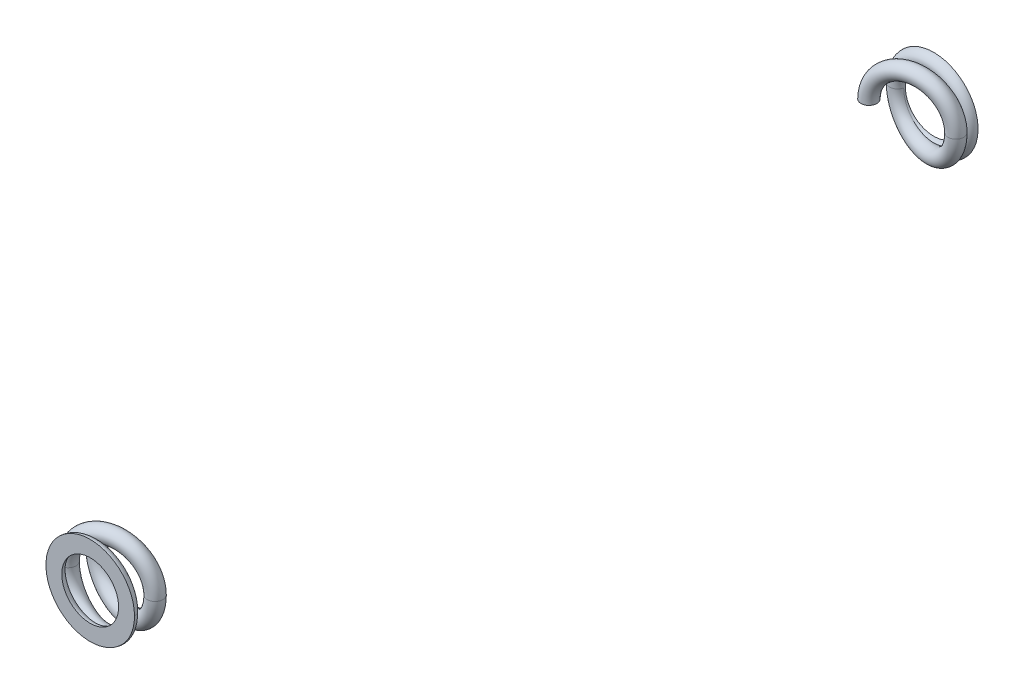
ISO-10303-21;
HEADER;
FILE_DESCRIPTION(('STEP AP214'),'2;1');
FILE_NAME('part.step','',(''),(''),'','','');
FILE_SCHEMA(('AUTOMOTIVE_DESIGN { 1 0 10303 214 1 1 1 1 }'));
ENDSEC;
DATA;
#1=APPLICATION_CONTEXT('core data for automotive mechanical design processes');
#2=APPLICATION_PROTOCOL_DEFINITION('international standard','automotive_design',2000,#1);
#3=PRODUCT_CONTEXT('',#1,'mechanical');
#4=PRODUCT('Part','Part','',(#3));
#5=PRODUCT_RELATED_PRODUCT_CATEGORY('part','',(#4));
#6=PRODUCT_DEFINITION_FORMATION('','',#4);
#7=PRODUCT_DEFINITION_CONTEXT('part definition',#1,'design');
#8=PRODUCT_DEFINITION('design','',#6,#7);
#9=PRODUCT_DEFINITION_SHAPE('','',#8);
#10=(LENGTH_UNIT() NAMED_UNIT(*) SI_UNIT(.MILLI.,.METRE.));
#11=(NAMED_UNIT(*) PLANE_ANGLE_UNIT() SI_UNIT($,.RADIAN.));
#12=(NAMED_UNIT(*) SI_UNIT($,.STERADIAN.) SOLID_ANGLE_UNIT());
#13=UNCERTAINTY_MEASURE_WITH_UNIT(LENGTH_MEASURE(1.E-05),#10,'distance_accuracy_value','');
#14=(GEOMETRIC_REPRESENTATION_CONTEXT(3) GLOBAL_UNCERTAINTY_ASSIGNED_CONTEXT((#13)) GLOBAL_UNIT_ASSIGNED_CONTEXT((#10,
#11,#12)) REPRESENTATION_CONTEXT('',''));
#15=CARTESIAN_POINT('',(0.,0.,0.));
#16=DIRECTION('',(0.,0.,1.));
#17=DIRECTION('',(1.,0.,0.));
#18=AXIS2_PLACEMENT_3D('',#15,#16,#17);
#19=CARTESIAN_POINT('',(0.,0.,-74.295));
#20=DIRECTION('',(0.,0.,1.));
#21=DIRECTION('',(1.,0.,0.));
#22=AXIS2_PLACEMENT_3D('',#19,#20,#21);
#23=TOROIDAL_SURFACE('',#22,3.2004,0.6985);
#24=CARTESIAN_POINT('',(0.,0.,-74.295));
#25=DIRECTION('',(0.,0.,-1.));
#26=DIRECTION('',(-1.,0.,0.));
#27=AXIS2_PLACEMENT_3D('',#24,#25,#26);
#28=CIRCLE('',#27,2.5019);
#29=CARTESIAN_POINT('',(-2.5019,0.,-74.295));
#30=VERTEX_POINT('',#29);
#31=EDGE_CURVE('E91',#30,#30,#28,.T.);
#32=ORIENTED_EDGE('',*,*,#31,.T.);
#33=EDGE_LOOP('',(#32));
#34=FACE_BOUND('',#33,.T.);
#35=CARTESIAN_POINT('',(0.,0.,-74.295));
#36=DIRECTION('',(0.,0.,1.));
#37=DIRECTION('',(1.,0.,0.));
#38=AXIS2_PLACEMENT_3D('',#35,#36,#37);
#39=CIRCLE('',#38,3.8989);
#40=CARTESIAN_POINT('',(-2.50189999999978,-2.99030393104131,-74.295));
#41=VERTEX_POINT('',#40);
#42=CARTESIAN_POINT('',(-3.89889999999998,-2.32938668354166E-11,-74.295));
#43=VERTEX_POINT('',#42);
#44=EDGE_CURVE('E71',#41,#43,#39,.T.);
#45=ORIENTED_EDGE('',*,*,#44,.T.);
#46=CARTESIAN_POINT('',(-3.20039999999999,0.,-74.295));
#47=DIRECTION('',(0.,1.,0.));
#48=DIRECTION('',(0.,0.,1.));
#49=AXIS2_PLACEMENT_3D('',#46,#47,#48);
#50=CIRCLE('',#49,0.6985);
#51=CARTESIAN_POINT('',(-2.51499769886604,0.,-74.1603674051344));
#52=VERTEX_POINT('',#51);
#53=EDGE_CURVE('E78',#43,#52,#50,.T.);
#54=ORIENTED_EDGE('',*,*,#53,.T.);
#55=CARTESIAN_POINT('',(-2.51499769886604,0.,-74.1603674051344));
#56=CARTESIAN_POINT('',(-2.51499932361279,-0.0266663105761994,-74.1603675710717));
#57=CARTESIAN_POINT('',(-2.51458247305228,-0.0533396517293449,-74.160327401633));
#58=CARTESIAN_POINT('',(-2.51044261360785,-0.185709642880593,-74.1599284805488));
#59=CARTESIAN_POINT('',(-2.50058220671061,-0.291288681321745,-74.158978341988));
#60=CARTESIAN_POINT('',(-2.47188505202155,-0.474964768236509,-74.1562144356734));
#61=CARTESIAN_POINT('',(-2.45580670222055,-0.553514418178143,-74.154666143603));
#62=CARTESIAN_POINT('',(-2.42643453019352,-0.669239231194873,-74.151839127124));
#63=CARTESIAN_POINT('',(-2.41588545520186,-0.707133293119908,-74.1508239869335));
#64=CARTESIAN_POINT('',(-2.38154202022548,-0.820377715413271,-74.1475199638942));
#65=CARTESIAN_POINT('',(-2.35512181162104,-0.894947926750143,-74.1449792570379));
#66=CARTESIAN_POINT('',(-2.29554751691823,-1.04139438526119,-74.139254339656));
#67=CARTESIAN_POINT('',(-2.26238483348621,-1.11326705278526,-74.1360693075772));
#68=CARTESIAN_POINT('',(-2.15880543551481,-1.31311642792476,-74.1261297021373));
#69=CARTESIAN_POINT('',(-2.08060271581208,-1.43713118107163,-74.1186344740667));
#70=CARTESIAN_POINT('',(-1.90462634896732,-1.67035983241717,-74.1018045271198));
#71=CARTESIAN_POINT('',(-1.80682997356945,-1.77955629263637,-74.0924676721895));
#72=CARTESIAN_POINT('',(-1.59420158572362,-1.98063867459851,-74.0722200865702));
#73=CARTESIAN_POINT('',(-1.4793029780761,-2.07245358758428,-74.0613032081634));
#74=CARTESIAN_POINT('',(-1.23613228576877,-2.2359273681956,-74.038268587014));
#75=CARTESIAN_POINT('',(-1.10786252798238,-2.30758973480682,-74.0261510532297));
#76=CARTESIAN_POINT('',(-0.838137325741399,-2.43067511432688,-74.0007579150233));
#77=CARTESIAN_POINT('',(-0.696432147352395,-2.48154643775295,-73.9874609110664));
#78=CARTESIAN_POINT('',(-0.406629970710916,-2.55931761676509,-73.960375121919));
#79=CARTESIAN_POINT('',(-0.258531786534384,-2.58621300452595,-73.9465862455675));
#80=CARTESIAN_POINT('',(0.0437608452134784,-2.61591850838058,-73.9185660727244));
#81=CARTESIAN_POINT('',(0.198015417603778,-2.61811525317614,-73.9043322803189));
#82=CARTESIAN_POINT('',(0.504789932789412,-2.59698049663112,-73.8761692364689));
#83=CARTESIAN_POINT('',(0.657309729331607,-2.57364685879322,-73.8622400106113));
#84=CARTESIAN_POINT('',(0.959311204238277,-2.50153282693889,-73.8348166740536));
#85=CARTESIAN_POINT('',(1.1086821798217,-2.45228317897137,-73.8213356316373));
#86=CARTESIAN_POINT('',(1.39718536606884,-2.3294543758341,-73.7954675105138));
#87=CARTESIAN_POINT('',(1.53631625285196,-2.2558720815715,-73.7830805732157));
#88=CARTESIAN_POINT('',(1.80109210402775,-2.08583365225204,-73.7596787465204));
#89=CARTESIAN_POINT('',(1.92665626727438,-1.98925038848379,-73.7486720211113));
#90=CARTESIAN_POINT('',(2.15952049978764,-1.77591651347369,-73.7284226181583));
#91=CARTESIAN_POINT('',(2.26681949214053,-1.65916471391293,-73.7191800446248));
#92=CARTESIAN_POINT('',(2.45757627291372,-1.4109048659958,-73.7028846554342));
#93=CARTESIAN_POINT('',(2.54144384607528,-1.27971501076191,-73.6957939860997));
#94=CARTESIAN_POINT('',(2.68444983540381,-1.00449720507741,-73.6837937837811));
#95=CARTESIAN_POINT('',(2.74361628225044,-0.860484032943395,-73.678881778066));
#96=CARTESIAN_POINT('',(2.82795721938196,-0.584375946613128,-73.6719149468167));
#97=CARTESIAN_POINT('',(2.856698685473,-0.453383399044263,-73.6695591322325));
#98=CARTESIAN_POINT('',(2.88337643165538,-0.254607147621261,-73.667375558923));
#99=CARTESIAN_POINT('',(2.88952646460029,-0.187855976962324,-73.6668730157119));
#100=CARTESIAN_POINT('',(2.89625664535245,-0.0540464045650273,-73.6663234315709));
#101=CARTESIAN_POINT('',(2.89683466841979,0.0130121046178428,-73.666276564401));
#102=CARTESIAN_POINT('',(2.89460140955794,0.0800049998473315,-73.6664585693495));
#103=B_SPLINE_CURVE_WITH_KNOTS('',3,(#55,#56,#57,#58,#59,#60,#61,#62,#63,#64,#65,#66,#67,#68,
#69,#70,#71,#72,#73,#74,#75,#76,#77,#78,#79,#80,#81,#82,#83,#84,#85,#86,#87,#88,#89,#90,#91,#92,
#93,#94,#95,#96,#97,#98,#99,#100,#101,#102),.UNSPECIFIED.,.F.,.F.,(4,2,2,2,2,2,2,2,2,2,2,2,2,2,
2,2,2,2,2,2,2,2,2,4),(0.,0.0800148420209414,0.397203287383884,0.637432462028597,
0.755447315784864,0.992522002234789,1.22990090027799,1.66804998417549,2.10671028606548,
2.54712569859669,2.98746459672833,3.43882890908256,3.89027731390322,4.35291302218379,
4.81558744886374,5.28694324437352,5.75835987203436,6.23244514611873,6.70655836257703,
7.17177036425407,7.63645300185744,8.0369343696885,8.2378340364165,8.4388103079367),.UNSPECIFIED.);
#104=CARTESIAN_POINT('',(2.8959309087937,0.,-73.66635));
#105=VERTEX_POINT('',#104);
#106=EDGE_CURVE('E97',#52,#105,#103,.T.);
#107=ORIENTED_EDGE('',*,*,#106,.T.);
#108=CARTESIAN_POINT('',(3.50486908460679,-0.000200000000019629,-73.6663499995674));
#109=CARTESIAN_POINT('',(3.50488747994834,0.167871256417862,-73.6663413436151));
#110=CARTESIAN_POINT('',(3.49088865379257,0.336179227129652,-73.6654337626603));
#111=CARTESIAN_POINT('',(3.43477382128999,0.668751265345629,-73.6617391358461));
#112=CARTESIAN_POINT('',(3.39253564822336,0.832994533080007,-73.6589439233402));
#113=CARTESIAN_POINT('',(3.29120185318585,1.11931601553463,-73.6521514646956));
#114=CARTESIAN_POINT('',(3.23721216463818,1.24322595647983,-73.6485095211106));
#115=CARTESIAN_POINT('',(3.1109654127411,1.48143182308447,-73.6398906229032));
#116=CARTESIAN_POINT('',(3.03873374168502,1.59574082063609,-73.634915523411));
#117=CARTESIAN_POINT('',(2.91571727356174,1.75541613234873,-73.6263794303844));
#118=CARTESIAN_POINT('',(2.87235842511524,1.80659466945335,-73.6233615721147));
#119=CARTESIAN_POINT('',(2.78008232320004,1.90349277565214,-73.6169470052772));
#120=CARTESIAN_POINT('',(2.73118786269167,1.94923324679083,-73.6135518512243));
#121=CARTESIAN_POINT('',(2.64497063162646,2.0160364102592,-73.6076756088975));
#122=CARTESIAN_POINT('',(2.60997034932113,2.0400010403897,-73.605315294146));
#123=CARTESIAN_POINT('',(2.55297981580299,2.06855108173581,-73.6016731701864));
#124=CARTESIAN_POINT('',(2.53321140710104,2.07683976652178,-73.6004408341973));
#125=CARTESIAN_POINT('',(2.50889295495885,2.08200503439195,-73.5990662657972));
#126=CARTESIAN_POINT('',(2.5052539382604,2.0826536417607,-73.5988640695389));
#127=CARTESIAN_POINT('',(2.49792298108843,2.08360923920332,-73.5984673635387));
#128=CARTESIAN_POINT('',(2.49423096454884,2.08391567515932,-73.5982728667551));
#129=CARTESIAN_POINT('',(2.48679034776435,2.08408307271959,-73.5978950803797));
#130=CARTESIAN_POINT('',(2.48304157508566,2.0839390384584,-73.59771193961));
#131=CARTESIAN_POINT('',(2.47561712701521,2.08303386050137,-73.5973696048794));
#132=CARTESIAN_POINT('',(2.47194125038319,2.08227476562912,-73.5972103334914));
#133=CARTESIAN_POINT('',(2.46602335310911,2.08036161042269,-73.5969774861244));
#134=CARTESIAN_POINT('',(2.46371255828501,2.07942420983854,-73.5968930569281));
#135=CARTESIAN_POINT('',(2.45927886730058,2.07717781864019,-73.596746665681));
#136=CARTESIAN_POINT('',(2.45715572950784,2.07586931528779,-73.5966846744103));
#137=CARTESIAN_POINT('',(2.45316838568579,2.07289100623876,-73.5965867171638));
#138=CARTESIAN_POINT('',(2.45130499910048,2.0712200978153,-73.596550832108));
#139=CARTESIAN_POINT('',(2.44789513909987,2.06758040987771,-73.5965060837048));
#140=CARTESIAN_POINT('',(2.44634900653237,2.0656113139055,-73.5964972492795));
#141=CARTESIAN_POINT('',(2.44319935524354,2.06088530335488,-73.5965052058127));
#142=CARTESIAN_POINT('',(2.44169790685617,2.05806099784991,-73.5965297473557));
#143=CARTESIAN_POINT('',(2.43916071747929,2.05221282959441,-73.5966106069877));
#144=CARTESIAN_POINT('',(2.43812596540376,2.04918855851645,-73.5966669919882));
#145=CARTESIAN_POINT('',(2.43577358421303,2.04067037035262,-73.5968556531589));
#146=CARTESIAN_POINT('',(2.43485317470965,2.03507047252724,-73.5970129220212));
#147=CARTESIAN_POINT('',(2.43378536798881,2.0238004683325,-73.5973716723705));
#148=CARTESIAN_POINT('',(2.43364074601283,2.01813018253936,-73.5975733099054));
#149=CARTESIAN_POINT('',(2.43409589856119,1.98811403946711,-73.5987072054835));
#150=CARTESIAN_POINT('',(2.43873263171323,1.96394913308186,-73.599852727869));
#151=CARTESIAN_POINT('',(2.45028607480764,1.91618331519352,-73.6022448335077));
#152=CARTESIAN_POINT('',(2.45722779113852,1.8925917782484,-73.6034924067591));
#153=CARTESIAN_POINT('',(2.47931861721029,1.8233877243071,-73.6072321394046));
#154=CARTESIAN_POINT('',(2.49598386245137,1.77821974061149,-73.6097771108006));
#155=CARTESIAN_POINT('',(2.52992378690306,1.68811617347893,-73.6148236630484));
#156=CARTESIAN_POINT('',(2.54719931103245,1.64318101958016,-73.6173251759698));
#157=CARTESIAN_POINT('',(2.58135014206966,1.55346826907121,-73.6222118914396));
#158=CARTESIAN_POINT('',(2.59822733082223,1.5086915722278,-73.6245977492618));
#159=CARTESIAN_POINT('',(2.6311403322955,1.41884567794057,-73.6292298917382));
#160=CARTESIAN_POINT('',(2.64717644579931,1.3737765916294,-73.6314762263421));
#161=CARTESIAN_POINT('',(2.69400406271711,1.23670788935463,-73.6380271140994));
#162=CARTESIAN_POINT('',(2.72302494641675,1.14407302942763,-73.6420746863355));
#163=CARTESIAN_POINT('',(2.77494197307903,0.957028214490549,-73.649329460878));
#164=CARTESIAN_POINT('',(2.79783674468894,0.862617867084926,-73.652536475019));
#165=CARTESIAN_POINT('',(2.8367713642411,0.672257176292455,-73.6580022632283));
#166=CARTESIAN_POINT('',(2.85280412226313,0.576305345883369,-73.660260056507));
#167=CARTESIAN_POINT('',(2.8775264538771,0.383448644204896,-73.6637467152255));
#168=CARTESIAN_POINT('',(2.88621816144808,0.286544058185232,-73.6649758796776));
#169=CARTESIAN_POINT('',(2.89273490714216,0.157866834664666,-73.6658977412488));
#170=CARTESIAN_POINT('',(2.8939352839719,0.126244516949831,-73.6660675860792));
#171=CARTESIAN_POINT('',(2.89553358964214,0.0630157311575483,-73.6662937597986));
#172=CARTESIAN_POINT('',(2.89593244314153,0.031409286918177,-73.6663502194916));
#173=CARTESIAN_POINT('',(2.8959309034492,-0.000200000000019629,-73.6663499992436));
#174=B_SPLINE_CURVE_WITH_KNOTS('',3,(#108,#109,#110,#111,#112,#113,#114,#115,#116,#117,#118,
#119,#120,#121,#122,#123,#124,#125,#126,#127,#128,#129,#130,#131,#132,#133,#134,#135,#136,#137,
#138,#139,#140,#141,#142,#143,#144,#145,#146,#147,#148,#149,#150,#151,#152,#153,#154,#155,#156,
#157,#158,#159,#160,#161,#162,#163,#164,#165,#166,#167,#168,#169,#170,#171,#172,#173),
.UNSPECIFIED.,.F.,.F.,(4,2,2,2,2,2,2,2,2,2,2,2,2,2,2,2,2,2,2,2,2,2,2,2,2,2,2,2,2,2,2,2,4),(0.,
0.504062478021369,1.01031982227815,1.41465310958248,1.8184266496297,2.01958804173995,
2.21994936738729,2.34691214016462,2.41052777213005,2.42161920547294,2.4327285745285,
2.44396158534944,2.45515733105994,2.4626129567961,2.47005883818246,2.47752770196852,
2.48500454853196,2.49454623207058,2.50410804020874,2.52104359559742,2.5380396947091,
2.61117809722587,2.68513740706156,2.82959438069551,2.97425985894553,3.11797645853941,
3.26164130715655,3.55293406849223,3.84429198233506,4.13595020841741,4.42752362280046,
4.52245276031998,4.61727232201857),.UNSPECIFIED.);
#175=CARTESIAN_POINT('',(3.50486909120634,0.,-73.66635));
#176=VERTEX_POINT('',#175);
#177=EDGE_CURVE('E105',#176,#105,#174,.T.);
#178=ORIENTED_EDGE('',*,*,#177,.F.);
#179=CARTESIAN_POINT('',(-3.885802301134,0.,-74.4296325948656));
#180=CARTESIAN_POINT('',(-3.8858023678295,-0.0266697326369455,-74.4296326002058));
#181=CARTESIAN_POINT('',(-3.88553285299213,-0.0533399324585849,-74.429606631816));
#182=CARTESIAN_POINT('',(-3.88405717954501,-0.126349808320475,-74.4294644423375));
#183=CARTESIAN_POINT('',(-3.88230654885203,-0.172679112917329,-74.4292957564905));
#184=CARTESIAN_POINT('',(-3.87660412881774,-0.27562550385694,-74.428746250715));
#185=CARTESIAN_POINT('',(-3.87224681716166,-0.332220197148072,-74.4283263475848));
#186=CARTESIAN_POINT('',(-3.86180653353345,-0.438026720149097,-74.4273200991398));
#187=CARTESIAN_POINT('',(-3.85601143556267,-0.487267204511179,-74.4267615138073));
#188=CARTESIAN_POINT('',(-3.84795424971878,-0.546165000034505,-74.425984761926));
#189=CARTESIAN_POINT('',(-3.84657852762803,-0.555948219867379,-74.4258521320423));
#190=CARTESIAN_POINT('',(-3.83951609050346,-0.604841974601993,-74.425171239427));
#191=CARTESIAN_POINT('',(-3.83327957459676,-0.643872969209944,-74.4245699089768));
#192=CARTESIAN_POINT('',(-3.81279086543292,-0.760800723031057,-74.4225940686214));
#193=CARTESIAN_POINT('',(-3.79677510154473,-0.838395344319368,-74.4210492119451));
#194=CARTESIAN_POINT('',(-3.76009763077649,-0.992514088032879,-74.4175098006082));
#195=CARTESIAN_POINT('',(-3.7394318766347,-1.06903721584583,-74.4155148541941));
#196=CARTESIAN_POINT('',(-3.65305288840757,-1.35425084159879,-74.407172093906));
#197=CARTESIAN_POINT('',(-3.57206657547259,-1.55853646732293,-74.399342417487));
#198=CARTESIAN_POINT('',(-3.37695238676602,-1.95074019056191,-74.3804339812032));
#199=CARTESIAN_POINT('',(-3.26276782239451,-2.1386295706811,-74.3693496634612));
#200=CARTESIAN_POINT('',(-3.00455684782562,-2.49181031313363,-74.3442088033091));
#201=CARTESIAN_POINT('',(-2.86060126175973,-2.657153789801,-74.3301593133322));
#202=CARTESIAN_POINT('',(-2.54666918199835,-2.96052982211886,-74.2994121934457));
#203=CARTESIAN_POINT('',(-2.37670480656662,-3.09857502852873,-74.2827157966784));
#204=CARTESIAN_POINT('',(-2.01912286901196,-3.34055610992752,-74.2474467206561));
#205=CARTESIAN_POINT('',(-1.8319219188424,-3.44511375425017,-74.2289177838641));
#206=CARTESIAN_POINT('',(-1.44242098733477,-3.620355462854,-74.1901944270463));
#207=CARTESIAN_POINT('',(-1.24012178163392,-3.69104126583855,-74.1700000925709));
#208=CARTESIAN_POINT('',(-0.830984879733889,-3.79488595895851,-74.1289569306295));
#209=CARTESIAN_POINT('',(-0.62434669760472,-3.8288407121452,-74.1081324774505));
#210=CARTESIAN_POINT('',(-0.208357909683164,-3.86066429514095,-74.0659855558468));
#211=CARTESIAN_POINT('',(0.000992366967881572,-3.85853746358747,-74.0446631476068));
#212=CARTESIAN_POINT('',(0.412167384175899,-3.81838872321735,-74.0025335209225));
#213=CARTESIAN_POINT('',(0.614059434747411,-3.7810571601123,-73.9817242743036));
#214=CARTESIAN_POINT('',(1.00854431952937,-3.67239135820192,-73.9407937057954));
#215=CARTESIAN_POINT('',(1.20113805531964,-3.60106042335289,-73.9206723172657));
#216=CARTESIAN_POINT('',(1.56895547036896,-3.42753427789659,-73.8819512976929));
#217=CARTESIAN_POINT('',(1.74437182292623,-3.32575080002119,-73.8633353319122));
#218=CARTESIAN_POINT('',(2.07563303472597,-3.09395480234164,-73.8278736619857));
#219=CARTESIAN_POINT('',(2.23147818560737,-2.96394270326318,-73.8110279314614));
#220=CARTESIAN_POINT('',(2.51910304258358,-2.67978407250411,-73.7796208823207));
#221=CARTESIAN_POINT('',(2.6509193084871,-2.52567487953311,-73.7650560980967));
#222=CARTESIAN_POINT('',(2.88751306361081,-2.19784400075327,-73.7386061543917));
#223=CARTESIAN_POINT('',(2.99229797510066,-2.02412771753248,-73.7267202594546));
#224=CARTESIAN_POINT('',(3.17499592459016,-1.65806706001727,-73.7057267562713));
#225=CARTESIAN_POINT('',(3.25224607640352,-1.46538971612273,-73.6966882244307));
#226=CARTESIAN_POINT('',(3.37614474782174,-1.07005228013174,-73.6820125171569));
#227=CARTESIAN_POINT('',(3.42275155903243,-0.867378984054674,-73.6763799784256));
#228=CARTESIAN_POINT('',(3.47144409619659,-0.551792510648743,-73.670454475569));
#229=CARTESIAN_POINT('',(3.48414639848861,-0.440410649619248,-73.6688972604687));
#230=CARTESIAN_POINT('',(3.50094682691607,-0.216960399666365,-73.6668340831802));
#231=CARTESIAN_POINT('',(3.50504434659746,-0.104891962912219,-73.6663281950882));
#232=CARTESIAN_POINT('',(3.50468262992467,0.118930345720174,-73.6663731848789));
#233=CARTESIAN_POINT('',(3.50024594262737,0.230684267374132,-73.6669212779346));
#234=CARTESIAN_POINT('',(3.48279007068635,0.453490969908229,-73.6690626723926));
#235=CARTESIAN_POINT('',(3.46977219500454,0.564543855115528,-73.6706558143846));
#236=CARTESIAN_POINT('',(3.45242788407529,0.674922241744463,-73.6727685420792));
#237=B_SPLINE_CURVE_WITH_KNOTS('',3,(#179,#180,#181,#182,#183,#184,#185,#186,#187,#188,#189,
#190,#191,#192,#193,#194,#195,#196,#197,#198,#199,#200,#201,#202,#203,#204,#205,#206,#207,#208,
#209,#210,#211,#212,#213,#214,#215,#216,#217,#218,#219,#220,#221,#222,#223,#224,#225,#226,#227,
#228,#229,#230,#231,#232,#233,#234,#235,#236),.UNSPECIFIED.,.F.,.F.,(4,2,2,2,2,2,2,2,2,2,2,2,2,
2,2,2,2,2,2,2,2,2,2,2,2,2,2,2,4),(0.,0.0800091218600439,0.219067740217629,0.389305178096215,
0.538016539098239,0.567657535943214,0.686234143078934,0.923800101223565,1.16157363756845,
1.81779636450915,2.47514629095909,3.13095003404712,3.78644914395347,4.42895738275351,
5.07143263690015,5.69968972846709,6.32787127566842,6.9439851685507,7.56003920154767,
8.16811386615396,8.77617946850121,9.38331203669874,9.99027772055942,10.6110004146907,
11.2325662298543,11.5686282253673,11.9047139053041,12.2399128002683,12.5750605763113),.UNSPECIFIED.);
#238=EDGE_CURVE('E66',#176,#41,#237,.F.);
#239=ORIENTED_EDGE('',*,*,#238,.T.);
#240=EDGE_LOOP('',(#45,#54,#107,#178,#239));
#241=FACE_BOUND('',#240,.T.);
#242=ADVANCED_FACE('F53',(#34,#241),#23,.T.);
#243=CARTESIAN_POINT('',(0.,0.,-73.66635));
#244=DIRECTION('',(0.192745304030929,0.,-0.981248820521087));
#245=DIRECTION('',(-0.981248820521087,0.,-0.192745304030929));
#246=AXIS2_PLACEMENT_3D('',#243,#244,#245);
#247=TOROIDAL_SURFACE('',#246,3.26155806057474,0.6985);
#248=CARTESIAN_POINT('',(-0.159887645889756,-2.86803935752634,-74.295));
#249=CARTESIAN_POINT('',(-0.132805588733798,-2.87870419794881,-74.295));
#250=CARTESIAN_POINT('',(-0.105711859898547,-2.88933814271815,-74.295));
#251=CARTESIAN_POINT('',(-0.0515662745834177,-2.91071256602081,-74.295));
#252=CARTESIAN_POINT('',(-0.0245144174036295,-2.92145304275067,-74.295));
#253=CARTESIAN_POINT('',(0.029471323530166,-2.94327057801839,-74.295));
#254=CARTESIAN_POINT('',(0.056405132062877,-2.95434782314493,-74.295));
#255=CARTESIAN_POINT('',(0.109989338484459,-2.97716629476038,-74.295));
#256=CARTESIAN_POINT('',(0.13663980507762,-2.98890735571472,-74.295));
#257=CARTESIAN_POINT('',(0.190447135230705,-3.01407838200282,-74.295));
#258=CARTESIAN_POINT('',(0.217581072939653,-3.02755736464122,-74.295));
#259=CARTESIAN_POINT('',(0.270582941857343,-3.0567742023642,-74.295));
#260=CARTESIAN_POINT('',(0.296455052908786,-3.07250380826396,-74.295));
#261=CARTESIAN_POINT('',(0.330417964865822,-3.09739404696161,-74.295));
#262=CARTESIAN_POINT('',(0.339794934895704,-3.1047699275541,-74.295));
#263=CARTESIAN_POINT('',(0.357832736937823,-3.12040285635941,-74.295));
#264=CARTESIAN_POINT('',(0.366492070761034,-3.12866166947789,-74.295));
#265=CARTESIAN_POINT('',(0.382795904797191,-3.14638370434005,-74.295));
#266=CARTESIAN_POINT('',(0.390423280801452,-3.15586309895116,-74.295));
#267=CARTESIAN_POINT('',(0.403794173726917,-3.17606442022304,-74.295));
#268=CARTESIAN_POINT('',(0.409546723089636,-3.18678004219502,-74.295));
#269=CARTESIAN_POINT('',(0.416765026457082,-3.20527908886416,-74.295));
#270=CARTESIAN_POINT('',(0.419027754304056,-3.21275002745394,-74.295));
#271=CARTESIAN_POINT('',(0.422243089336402,-3.22797002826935,-74.295));
#272=CARTESIAN_POINT('',(0.423196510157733,-3.23571891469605,-74.295));
#273=CARTESIAN_POINT('',(0.423743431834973,-3.25125825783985,-74.295));
#274=CARTESIAN_POINT('',(0.423337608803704,-3.2590486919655,-74.295));
#275=CARTESIAN_POINT('',(0.42127319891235,-3.27446137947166,-74.295));
#276=CARTESIAN_POINT('',(0.419613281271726,-3.28208344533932,-74.295));
#277=CARTESIAN_POINT('',(0.414332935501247,-3.30008234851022,-74.295));
#278=CARTESIAN_POINT('',(0.410187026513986,-3.31030324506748,-74.295));
#279=CARTESIAN_POINT('',(0.400355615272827,-3.32997261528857,-74.295));
#280=CARTESIAN_POINT('',(0.394666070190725,-3.33941897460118,-74.295));
#281=CARTESIAN_POINT('',(0.377513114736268,-3.36438274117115,-74.295));
#282=CARTESIAN_POINT('',(0.364926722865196,-3.37911922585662,-74.295));
#283=CARTESIAN_POINT('',(0.337839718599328,-3.40668624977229,-74.295));
#284=CARTESIAN_POINT('',(0.323333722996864,-3.41951120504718,-74.295));
#285=CARTESIAN_POINT('',(0.275942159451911,-3.45738931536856,-74.295));
#286=CARTESIAN_POINT('',(0.24092548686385,-3.47975050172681,-74.295));
#287=CARTESIAN_POINT('',(0.168348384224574,-3.51974285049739,-74.295));
#288=CARTESIAN_POINT('',(0.130781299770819,-3.53736099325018,-74.295));
#289=CARTESIAN_POINT('',(0.0516868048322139,-3.569869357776,-74.295));
#290=CARTESIAN_POINT('',(0.0100593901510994,-3.58451533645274,-74.295));
#291=CARTESIAN_POINT('',(-0.0742811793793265,-3.61030060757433,-74.295));
#292=CARTESIAN_POINT('',(-0.116995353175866,-3.62143646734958,-74.295));
#293=CARTESIAN_POINT('',(-0.24623048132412,-3.65024568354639,-74.295));
#294=CARTESIAN_POINT('',(-0.333787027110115,-3.66329913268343,-74.295));
#295=CARTESIAN_POINT('',(-0.562575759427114,-3.68380088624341,-74.295));
#296=CARTESIAN_POINT('',(-0.704509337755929,-3.68319363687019,-74.295));
#297=CARTESIAN_POINT('',(-0.986369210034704,-3.65953371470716,-74.295));
#298=CARTESIAN_POINT('',(-1.1262940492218,-3.63646553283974,-74.295));
#299=CARTESIAN_POINT('',(-1.40544956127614,-3.56934473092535,-74.295));
#300=CARTESIAN_POINT('',(-1.54453179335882,-3.52467972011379,-74.295));
#301=CARTESIAN_POINT('',(-1.81501877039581,-3.416413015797,-74.295));
#302=CARTESIAN_POINT('',(-1.94642402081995,-3.35281257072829,-74.295));
#303=CARTESIAN_POINT('',(-2.2241585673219,-3.19472983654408,-74.295));
#304=CARTESIAN_POINT('',(-2.36844915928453,-3.09665214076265,-74.295));
#305=CARTESIAN_POINT('',(-2.64056520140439,-2.87980422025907,-74.295));
#306=CARTESIAN_POINT('',(-2.76837903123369,-2.76101952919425,-74.295));
#307=CARTESIAN_POINT('',(-3.01780476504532,-2.49276194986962,-74.295));
#308=CARTESIAN_POINT('',(-3.13736342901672,-2.34137764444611,-74.295));
#309=CARTESIAN_POINT('',(-3.35164125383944,-2.0219816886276,-74.295));
#310=CARTESIAN_POINT('',(-3.44635278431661,-1.85396495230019,-74.295));
#311=CARTESIAN_POINT('',(-3.61628088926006,-1.49129343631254,-74.295));
#312=CARTESIAN_POINT('',(-3.68925025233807,-1.29558440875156,-74.295));
#313=CARTESIAN_POINT('',(-3.80343352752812,-0.895106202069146,-74.295));
#314=CARTESIAN_POINT('',(-3.84463604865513,-0.690333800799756,-74.295));
#315=CARTESIAN_POINT('',(-3.89630659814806,-0.26420467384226,-74.295));
#316=CARTESIAN_POINT('',(-3.90474171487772,-0.0425993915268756,-74.295));
#317=CARTESIAN_POINT('',(-3.88515775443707,0.399028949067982,-74.295));
#318=CARTESIAN_POINT('',(-3.85713119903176,0.619051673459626,-74.295));
#319=CARTESIAN_POINT('',(-3.76397909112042,1.05604628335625,-74.295));
#320=CARTESIAN_POINT('',(-3.698078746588,1.27285429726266,-74.295));
#321=CARTESIAN_POINT('',(-3.52960462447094,1.69177594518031,-74.295));
#322=CARTESIAN_POINT('',(-3.42703528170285,1.8938913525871,-74.295));
#323=CARTESIAN_POINT('',(-3.19115278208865,2.27010682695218,-74.295));
#324=CARTESIAN_POINT('',(-3.05896720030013,2.44491181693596,-74.295));
#325=CARTESIAN_POINT('',(-2.76498401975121,2.76768958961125,-74.295));
#326=CARTESIAN_POINT('',(-2.60319347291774,2.91566874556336,-74.295));
#327=CARTESIAN_POINT('',(-2.26710716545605,3.16848339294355,-74.295));
#328=CARTESIAN_POINT('',(-2.0945905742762,3.27568223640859,-74.295));
#329=CARTESIAN_POINT('',(-1.73239205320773,3.45586783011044,-74.295));
#330=CARTESIAN_POINT('',(-1.54272482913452,3.52888356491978,-74.295));
#331=CARTESIAN_POINT('',(-1.20919586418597,3.61957721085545,-74.295));
#332=CARTESIAN_POINT('',(-1.06797265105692,3.64715659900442,-74.295));
#333=CARTESIAN_POINT('',(-0.783038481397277,3.67970147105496,-74.295));
#334=CARTESIAN_POINT('',(-0.639335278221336,3.68472785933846,-74.295));
#335=CARTESIAN_POINT('',(-0.4225273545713,3.67244634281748,-74.295));
#336=CARTESIAN_POINT('',(-0.348814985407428,3.66474484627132,-74.295));
#337=CARTESIAN_POINT('',(-0.202587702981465,3.64140287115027,-74.295));
#338=CARTESIAN_POINT('',(-0.130072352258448,3.62576536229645,-74.295));
#339=CARTESIAN_POINT('',(-0.00806893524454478,3.59075911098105,-74.295));
#340=CARTESIAN_POINT('',(0.0420916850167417,3.57372403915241,-74.295));
#341=CARTESIAN_POINT('',(0.140082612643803,3.53362517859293,-74.295));
#342=CARTESIAN_POINT('',(0.187914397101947,3.51056527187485,-74.295));
#343=CARTESIAN_POINT('',(0.255947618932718,3.4696026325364,-74.295));
#344=CARTESIAN_POINT('',(0.278041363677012,3.45485514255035,-74.295));
#345=CARTESIAN_POINT('',(0.320106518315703,3.42263394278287,-74.295));
#346=CARTESIAN_POINT('',(0.340087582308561,3.40517362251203,-74.295));
#347=CARTESIAN_POINT('',(0.365837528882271,3.37761561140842,-74.295));
#348=CARTESIAN_POINT('',(0.373200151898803,3.36901652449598,-74.295));
#349=CARTESIAN_POINT('',(0.38693772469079,3.35102490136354,-74.295));
#350=CARTESIAN_POINT('',(0.393311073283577,3.34163111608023,-74.295));
#351=CARTESIAN_POINT('',(0.404729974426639,3.3218582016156,-74.295));
#352=CARTESIAN_POINT('',(0.409754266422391,3.31146644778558,-74.295));
#353=CARTESIAN_POINT('',(0.417704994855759,3.2899142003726,-74.295));
#354=CARTESIAN_POINT('',(0.420640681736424,3.27875733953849,-74.295));
#355=CARTESIAN_POINT('',(0.423278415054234,3.25975818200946,-74.295));
#356=CARTESIAN_POINT('',(0.423721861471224,3.25201872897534,-74.295));
#357=CARTESIAN_POINT('',(0.423270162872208,3.23657781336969,-74.295));
#358=CARTESIAN_POINT('',(0.422375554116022,3.22887633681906,-74.295));
#359=CARTESIAN_POINT('',(0.41929309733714,3.21375961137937,-74.295));
#360=CARTESIAN_POINT('',(0.417108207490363,3.20634374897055,-74.295));
#361=CARTESIAN_POINT('',(0.411621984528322,3.19193989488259,-74.295));
#362=CARTESIAN_POINT('',(0.408319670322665,3.18495228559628,-74.295));
#363=CARTESIAN_POINT('',(0.398725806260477,3.16770401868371,-74.295));
#364=CARTESIAN_POINT('',(0.391795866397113,3.15780161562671,-74.295));
#365=CARTESIAN_POINT('',(0.376530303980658,3.13915294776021,-74.295));
#366=CARTESIAN_POINT('',(0.368190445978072,3.13041031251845,-74.295));
#367=CARTESIAN_POINT('',(0.347584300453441,3.1110214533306,-74.295));
#368=CARTESIAN_POINT('',(0.334958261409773,3.10076407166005,-74.295));
#369=CARTESIAN_POINT('',(0.308777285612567,3.08149454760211,-74.295));
#370=CARTESIAN_POINT('',(0.295220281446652,3.07248532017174,-74.295));
#371=CARTESIAN_POINT('',(0.253565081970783,3.04668509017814,-74.295));
#372=CARTESIAN_POINT('',(0.224640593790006,3.03124978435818,-74.295));
#373=CARTESIAN_POINT('',(0.16265685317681,3.00063366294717,-74.295));
#374=CARTESIAN_POINT('',(0.129495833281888,2.98567257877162,-74.295));
#375=CARTESIAN_POINT('',(0.062678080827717,2.95688493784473,-74.295));
#376=CARTESIAN_POINT('',(0.0290212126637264,2.943058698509,-74.295));
#377=CARTESIAN_POINT('',(-0.0723284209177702,2.90220335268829,-74.295));
#378=CARTESIAN_POINT('',(-0.140285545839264,2.87584739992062,-74.295));
#379=CARTESIAN_POINT('',(-0.275602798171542,2.8222943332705,-74.295));
#380=CARTESIAN_POINT('',(-0.342964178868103,2.79510045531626,-74.295));
#381=CARTESIAN_POINT('',(-0.476757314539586,2.73859268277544,-74.295));
#382=CARTESIAN_POINT('',(-0.543189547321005,2.70927992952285,-74.295));
#383=CARTESIAN_POINT('',(-0.709106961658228,2.63171815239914,-74.295));
#384=CARTESIAN_POINT('',(-0.807726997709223,2.58157713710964,-74.295));
#385=CARTESIAN_POINT('',(-1.00055902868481,2.47332386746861,-74.295));
#386=CARTESIAN_POINT('',(-1.09477004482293,2.41520985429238,-74.295));
#387=CARTESIAN_POINT('',(-1.27760254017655,2.29037663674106,-74.295));
#388=CARTESIAN_POINT('',(-1.3662136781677,2.22364216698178,-74.295));
#389=CARTESIAN_POINT('',(-1.53628833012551,2.08161659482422,-74.295));
#390=CARTESIAN_POINT('',(-1.61775193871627,2.00632560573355,-74.295));
#391=CARTESIAN_POINT('',(-1.80764385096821,1.8109685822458,-74.295));
#392=CARTESIAN_POINT('',(-1.91132527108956,1.68619327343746,-74.295));
#393=CARTESIAN_POINT('',(-2.09640009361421,1.42129665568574,-74.295));
#394=CARTESIAN_POINT('',(-2.17782526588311,1.2811976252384,-74.295));
#395=CARTESIAN_POINT('',(-2.31533003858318,0.988257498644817,-74.295));
#396=CARTESIAN_POINT('',(-2.37130078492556,0.835364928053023,-74.295));
#397=CARTESIAN_POINT('',(-2.45462745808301,0.521885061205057,-74.295));
#398=CARTESIAN_POINT('',(-2.48197861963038,0.361296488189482,-74.295));
#399=CARTESIAN_POINT('',(-2.50578148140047,0.0490153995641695,-74.295));
#400=CARTESIAN_POINT('',(-2.50423291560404,-0.102527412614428,-74.295));
#401=CARTESIAN_POINT('',(-2.47518277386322,-0.403029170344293,-74.295));
#402=CARTESIAN_POINT('',(-2.44769400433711,-0.551989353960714,-74.295));
#403=CARTESIAN_POINT('',(-2.36876205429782,-0.840414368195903,-74.295));
#404=CARTESIAN_POINT('',(-2.31777060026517,-0.980003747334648,-74.295));
#405=CARTESIAN_POINT('',(-2.19404895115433,-1.24926030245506,-74.295));
#406=CARTESIAN_POINT('',(-2.12130263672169,-1.37892003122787,-74.295));
#407=CARTESIAN_POINT('',(-1.95293138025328,-1.63130065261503,-74.295));
#408=CARTESIAN_POINT('',(-1.85639135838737,-1.75340842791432,-74.295));
#409=CARTESIAN_POINT('',(-1.64614657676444,-1.98143608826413,-74.295));
#410=CARTESIAN_POINT('',(-1.53246345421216,-2.08737604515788,-74.295));
#411=CARTESIAN_POINT('',(-1.31937469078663,-2.25989044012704,-74.295));
#412=CARTESIAN_POINT('',(-1.22271242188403,-2.32991142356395,-74.295));
#413=CARTESIAN_POINT('',(-1.02302971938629,-2.46019764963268,-74.295));
#414=CARTESIAN_POINT('',(-0.920008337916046,-2.52046143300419,-74.295));
#415=CARTESIAN_POINT('',(-0.709003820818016,-2.63219171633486,-74.295));
#416=CARTESIAN_POINT('',(-0.601007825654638,-2.68363358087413,-74.295));
#417=CARTESIAN_POINT('',(-0.436832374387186,-2.75571118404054,-74.295));
#418=CARTESIAN_POINT('',(-0.381735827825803,-2.77889239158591,-74.295));
#419=CARTESIAN_POINT('',(-0.271071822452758,-2.82410564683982,-74.295));
#420=CARTESIAN_POINT('',(-0.215504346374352,-2.84613765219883,-74.295));
#421=CARTESIAN_POINT('',(-0.159887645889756,-2.86803935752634,-74.295));
#422=B_SPLINE_CURVE_WITH_KNOTS('',3,(#248,#249,#250,#251,#252,#253,#254,#255,#256,#257,#258,
#259,#260,#261,#262,#263,#264,#265,#266,#267,#268,#269,#270,#271,#272,#273,#274,#275,#276,#277,
#278,#279,#280,#281,#282,#283,#284,#285,#286,#287,#288,#289,#290,#291,#292,#293,#294,#295,#296,
#297,#298,#299,#300,#301,#302,#303,#304,#305,#306,#307,#308,#309,#310,#311,#312,#313,#314,#315,
#316,#317,#318,#319,#320,#321,#322,#323,#324,#325,#326,#327,#328,#329,#330,#331,#332,#333,#334,
#335,#336,#337,#338,#339,#340,#341,#342,#343,#344,#345,#346,#347,#348,#349,#350,#351,#352,#353,
#354,#355,#356,#357,#358,#359,#360,#361,#362,#363,#364,#365,#366,#367,#368,#369,#370,#371,#372,
#373,#374,#375,#376,#377,#378,#379,#380,#381,#382,#383,#384,#385,#386,#387,#388,#389,#390,#391,
#392,#393,#394,#395,#396,#397,#398,#399,#400,#401,#402,#403,#404,#405,#406,#407,#408,#409,#410,
#411,#412,#413,#414,#415,#416,#417,#418,#419,#420,#421),.UNSPECIFIED.,.T.,.F.,(4,2,2,2,2,2,2,2,
2,2,2,2,2,2,2,2,2,2,2,2,2,2,2,2,2,2,2,2,2,2,2,2,2,2,2,2,2,2,2,2,2,2,2,2,2,2,2,2,2,2,2,2,2,2,2,2,
2,2,2,2,2,2,2,2,2,2,2,2,2,2,2,2,2,2,2,2,2,2,2,2,2,2,2,2,2,2,4),(0.,0.0873182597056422,
0.174635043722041,0.262001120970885,0.349345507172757,0.440212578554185,0.530754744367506,
0.566507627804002,0.60233336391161,0.638695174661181,0.674879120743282,0.698194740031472,
0.721495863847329,0.744785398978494,0.768099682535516,0.801000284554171,0.833987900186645,
0.891800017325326,0.949777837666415,1.07373024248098,1.19801950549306,1.33020062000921,
1.46251060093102,1.72731155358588,2.15090871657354,2.57479857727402,3.01148341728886,
3.44813947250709,3.96936618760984,4.49095851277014,5.06720570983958,5.64362966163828,
6.26751413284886,6.89162221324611,7.55388452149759,8.21628268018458,8.89274008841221,
9.56911571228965,10.2231469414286,10.8770225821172,11.4830910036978,12.088644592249,
12.5188605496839,12.9479140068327,13.1699421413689,13.3918872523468,13.5505760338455,
13.7091628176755,13.7887327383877,13.8679217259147,13.9018316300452,13.9357958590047,
13.9702675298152,14.0045855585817,14.0277360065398,14.0508771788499,14.0739655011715,
14.0970741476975,14.1331228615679,14.1692818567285,14.2179592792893,14.266748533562,
14.3649316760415,14.4740478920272,14.5831945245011,14.8018625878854,15.0197719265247,
15.2375647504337,15.5691477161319,15.9008039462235,16.2330557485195,16.5653031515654,
17.0497796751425,17.5335609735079,18.0193921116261,18.5053041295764,18.9577260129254,
19.4099246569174,19.8537728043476,20.297950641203,20.7630181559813,21.2275035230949,
21.584994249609,21.9425383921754,22.3010652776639,22.4803786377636,22.6596986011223),.UNSPECIFIED.);
#423=EDGE_CURVE('E12',#41,#43,#422,.T.);
#424=ORIENTED_EDGE('',*,*,#423,.F.);
#425=ORIENTED_EDGE('',*,*,#238,.F.);
#426=CARTESIAN_POINT('',(3.20039999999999,0.,-73.0377));
#427=DIRECTION('',(0.,-1.,0.));
#428=DIRECTION('',(-0.378262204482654,0.,0.92569849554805));
#429=AXIS2_PLACEMENT_3D('',#426,#427,#428);
#430=CIRCLE('',#429,0.6985);
#431=EDGE_CURVE('E99',#176,#105,#430,.T.);
#432=ORIENTED_EDGE('',*,*,#431,.T.);
#433=ORIENTED_EDGE('',*,*,#106,.F.);
#434=ORIENTED_EDGE('',*,*,#53,.F.);
#435=EDGE_LOOP('',(#424,#425,#432,#433,#434));
#436=FACE_BOUND('',#435,.T.);
#437=ADVANCED_FACE('F96',(#436),#247,.T.);
#438=CARTESIAN_POINT('',(0.,0.,-72.4090500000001));
#439=DIRECTION('',(-0.192745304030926,0.,-0.981248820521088));
#440=DIRECTION('',(-0.981248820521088,0.,0.192745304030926));
#441=AXIS2_PLACEMENT_3D('',#438,#439,#440);
#442=TOROIDAL_SURFACE('',#441,3.26155806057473,0.698500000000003);
#443=CARTESIAN_POINT('',(-3.20039999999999,0.,-71.7804));
#444=DIRECTION('',(0.,-1.,0.));
#445=DIRECTION('',(0.37826220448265,0.,0.925698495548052));
#446=AXIS2_PLACEMENT_3D('',#443,#444,#445);
#447=CIRCLE('',#446,0.698500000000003);
#448=CARTESIAN_POINT('',(-2.93618385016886,0.,-71.1337996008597));
#449=VERTEX_POINT('',#448);
#450=EDGE_CURVE('E134',#449,#449,#447,.T.);
#451=ORIENTED_EDGE('',*,*,#450,.F.);
#452=EDGE_LOOP('',(#451));
#453=FACE_BOUND('',#452,.T.);
#454=ORIENTED_EDGE('',*,*,#431,.F.);
#455=ORIENTED_EDGE('',*,*,#177,.T.);
#456=EDGE_LOOP('',(#454,#455));
#457=FACE_BOUND('',#456,.T.);
#458=ADVANCED_FACE('F119',(#453,#457),#442,.T.);
#459=CARTESIAN_POINT('',(-3.20039999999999,0.,-71.7804));
#460=DIRECTION('',(0.,-1.,0.));
#461=DIRECTION('',(0.37826220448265,0.,0.925698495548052));
#462=AXIS2_PLACEMENT_3D('',#459,#460,#461);
#463=PLANE('',#462);
#464=ORIENTED_EDGE('',*,*,#450,.T.);
#465=EDGE_LOOP('',(#464));
#466=FACE_BOUND('',#465,.T.);
#467=ADVANCED_FACE('F125',(#466),#463,.T.);
#468=CARTESIAN_POINT('',(3.89889999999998,-4.06308750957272,-74.295));
#469=DIRECTION('',(0.,0.,1.));
#470=DIRECTION('',(1.,0.,0.));
#471=AXIS2_PLACEMENT_3D('',#468,#469,#470);
#472=PLANE('',#471);
#473=ORIENTED_EDGE('',*,*,#44,.F.);
#474=ORIENTED_EDGE('',*,*,#423,.T.);
#475=EDGE_LOOP('',(#473,#474));
#476=FACE_BOUND('',#475,.T.);
#477=ORIENTED_EDGE('',*,*,#31,.F.);
#478=EDGE_LOOP('',(#477));
#479=FACE_BOUND('',#478,.T.);
#480=ADVANCED_FACE('F93',(#476,#479),#472,.F.);
#481=CLOSED_SHELL('',(#242,#437,#458,#467,#480));
#482=MANIFOLD_SOLID_BREP('B2',#481);
#483=CARTESIAN_POINT('',(0.,0.,-1.88595));
#484=DIRECTION('',(0.192745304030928,0.,0.981248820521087));
#485=DIRECTION('',(0.981248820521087,0.,-0.192745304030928));
#486=AXIS2_PLACEMENT_3D('',#483,#484,#485);
#487=TOROIDAL_SURFACE('',#486,3.26155806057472,0.6985);
#488=CARTESIAN_POINT('',(-2.89593090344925,-0.000200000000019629,-0.628650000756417));
#489=CARTESIAN_POINT('',(-2.89599116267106,0.10680510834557,-0.628639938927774));
#490=CARTESIAN_POINT('',(-2.89135758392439,0.21378509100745,-0.629297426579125));
#491=CARTESIAN_POINT('',(-2.87308968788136,0.426812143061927,-0.63187949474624));
#492=CARTESIAN_POINT('',(-2.85946796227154,0.532860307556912,-0.633802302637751));
#493=CARTESIAN_POINT('',(-2.82386860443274,0.741918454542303,-0.638810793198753));
#494=CARTESIAN_POINT('',(-2.80201492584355,0.844950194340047,-0.641879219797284));
#495=CARTESIAN_POINT('',(-2.75071521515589,1.04905373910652,-0.649057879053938));
#496=CARTESIAN_POINT('',(-2.72126867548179,1.1501254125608,-0.653168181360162));
#497=CARTESIAN_POINT('',(-2.66622273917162,1.31955653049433,-0.660858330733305));
#498=CARTESIAN_POINT('',(-2.64220742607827,1.38845363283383,-0.664215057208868));
#499=CARTESIAN_POINT('',(-2.5921152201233,1.52553441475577,-0.671260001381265));
#500=CARTESIAN_POINT('',(-2.56603653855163,1.59371741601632,-0.674948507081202));
#501=CARTESIAN_POINT('',(-2.52699078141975,1.69597963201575,-0.680615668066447));
#502=CARTESIAN_POINT('',(-2.51399204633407,1.73005323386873,-0.682526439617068));
#503=CARTESIAN_POINT('',(-2.48873860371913,1.79847047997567,-0.686352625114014));
#504=CARTESIAN_POINT('',(-2.47648363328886,1.83281402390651,-0.688268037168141));
#505=CARTESIAN_POINT('',(-2.45410814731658,1.90184610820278,-0.692016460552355));
#506=CARTESIAN_POINT('',(-2.44396780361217,1.93652792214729,-0.693850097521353));
#507=CARTESIAN_POINT('',(-2.43478815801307,1.99023069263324,-0.696333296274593));
#508=CARTESIAN_POINT('',(-2.43273504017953,2.00844303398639,-0.697117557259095));
#509=CARTESIAN_POINT('',(-2.43432961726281,2.02995380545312,-0.697826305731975));
#510=CARTESIAN_POINT('',(-2.43470754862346,2.03338856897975,-0.697932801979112));
#511=CARTESIAN_POINT('',(-2.43581628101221,2.0402093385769,-0.698125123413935));
#512=CARTESIAN_POINT('',(-2.43654765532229,2.0435952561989,-0.698210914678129));
#513=CARTESIAN_POINT('',(-2.43847327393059,2.05029059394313,-0.698355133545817));
#514=CARTESIAN_POINT('',(-2.43967378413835,2.05359830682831,-0.69841316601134));
#515=CARTESIAN_POINT('',(-2.44265882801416,2.05993830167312,-0.698488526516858));
#516=CARTESIAN_POINT('',(-2.44444098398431,2.06297164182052,-0.698506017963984));
#517=CARTESIAN_POINT('',(-2.44800324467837,2.06769897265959,-0.69849262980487));
#518=CARTESIAN_POINT('',(-2.44961644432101,2.06951846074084,-0.698474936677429));
#519=CARTESIAN_POINT('',(-2.45313109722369,2.07285352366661,-0.698413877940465));
#520=CARTESIAN_POINT('',(-2.45503240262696,2.0743692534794,-0.698370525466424));
#521=CARTESIAN_POINT('',(-2.45906117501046,2.07704984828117,-0.698259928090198));
#522=CARTESIAN_POINT('',(-2.46118823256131,2.07821533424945,-0.69819272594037));
#523=CARTESIAN_POINT('',(-2.46559746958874,2.08019923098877,-0.698038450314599));
#524=CARTESIAN_POINT('',(-2.46787980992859,2.08101727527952,-0.697951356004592));
#525=CARTESIAN_POINT('',(-2.47369740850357,2.08266814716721,-0.697714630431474));
#526=CARTESIAN_POINT('',(-2.47728771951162,2.08330321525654,-0.69755552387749));
#527=CARTESIAN_POINT('',(-2.48452136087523,2.08401609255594,-0.697216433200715));
#528=CARTESIAN_POINT('',(-2.48816481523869,2.08409227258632,-0.697036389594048));
#529=CARTESIAN_POINT('',(-2.49865788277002,2.08371478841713,-0.696499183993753));
#530=CARTESIAN_POINT('',(-2.50548391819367,2.08273103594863,-0.696126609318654));
#531=CARTESIAN_POINT('',(-2.51893861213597,2.07986984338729,-0.695365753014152));
#532=CARTESIAN_POINT('',(-2.52556657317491,2.07798956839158,-0.694977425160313));
#533=CARTESIAN_POINT('',(-2.55304293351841,2.06891244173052,-0.693334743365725));
#534=CARTESIAN_POINT('',(-2.5730023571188,2.05913839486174,-0.692059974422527));
#535=CARTESIAN_POINT('',(-2.61159616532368,2.03729316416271,-0.689543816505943));
#536=CARTESIAN_POINT('',(-2.63022154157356,2.02520807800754,-0.688302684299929));
#537=CARTESIAN_POINT('',(-2.67831110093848,1.99120910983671,-0.685064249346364));
#538=CARTESIAN_POINT('',(-2.70689882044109,1.96803559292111,-0.683103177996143));
#539=CARTESIAN_POINT('',(-2.7620377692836,1.91935300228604,-0.679300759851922));
#540=CARTESIAN_POINT('',(-2.78858441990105,1.89383894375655,-0.677459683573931));
#541=CARTESIAN_POINT('',(-2.86559101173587,1.8147379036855,-0.672112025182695));
#542=CARTESIAN_POINT('',(-2.91343727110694,1.75857657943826,-0.66877965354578));
#543=CARTESIAN_POINT('',(-2.9999124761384,1.64593706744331,-0.66277743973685));
#544=CARTESIAN_POINT('',(-3.038956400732,1.58977056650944,-0.660077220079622));
#545=CARTESIAN_POINT('',(-3.11221008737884,1.47429620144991,-0.655032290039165));
#546=CARTESIAN_POINT('',(-3.146415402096,1.41498551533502,-0.652687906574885));
#547=CARTESIAN_POINT('',(-3.24194061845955,1.23333408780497,-0.64617063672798));
#548=CARTESIAN_POINT('',(-3.29621772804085,1.10720946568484,-0.642510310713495));
#549=CARTESIAN_POINT('',(-3.38830305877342,0.842543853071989,-0.636342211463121));
#550=CARTESIAN_POINT('',(-3.42522171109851,0.703698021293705,-0.633896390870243));
#551=CARTESIAN_POINT('',(-3.47870618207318,0.422318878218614,-0.630364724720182));
#552=CARTESIAN_POINT('',(-3.49530649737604,0.279792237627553,-0.629276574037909));
#553=CARTESIAN_POINT('',(-3.50384209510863,0.0912333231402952,-0.628717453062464));
#554=CARTESIAN_POINT('',(-3.50487401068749,0.045507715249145,-0.628649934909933));
#555=CARTESIAN_POINT('',(-3.50486908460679,-0.000200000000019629,-0.628650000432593));
#556=B_SPLINE_CURVE_WITH_KNOTS('',3,(#488,#489,#490,#491,#492,#493,#494,#495,#496,#497,#498,
#499,#500,#501,#502,#503,#504,#505,#506,#507,#508,#509,#510,#511,#512,#513,#514,#515,#516,#517,
#518,#519,#520,#521,#522,#523,#524,#525,#526,#527,#528,#529,#530,#531,#532,#533,#534,#535,#536,
#537,#538,#539,#540,#541,#542,#543,#544,#545,#546,#547,#548,#549,#550,#551,#552,#553,#554,#555),
.UNSPECIFIED.,.F.,.F.,(4,2,2,2,2,2,2,2,2,2,2,2,2,2,2,2,2,2,2,2,2,2,2,2,2,2,2,2,2,2,2,2,2,4),(0.,
0.320872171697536,0.641295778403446,0.957075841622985,1.27287701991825,1.49195278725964,
1.71122059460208,1.82077891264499,1.93029827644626,2.03873929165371,2.09313941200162,
2.10349476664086,2.11386697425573,2.12438273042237,2.13485602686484,2.1421181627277,
2.14937658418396,2.15662205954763,2.16387515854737,2.17476058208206,2.18567772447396,
2.20628133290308,2.22695052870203,2.29322245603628,2.35990635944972,2.4701949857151,
2.58072421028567,2.8017080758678,3.00684083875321,3.21216093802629,3.62256257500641,
4.05216996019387,4.48104693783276,4.61820601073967),.UNSPECIFIED.);
#557=CARTESIAN_POINT('',(-2.8959309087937,1.1594891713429E-11,-0.628649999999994));
#558=VERTEX_POINT('',#557);
#559=CARTESIAN_POINT('',(-3.50486909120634,0.,-0.628650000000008));
#560=VERTEX_POINT('',#559);
#561=EDGE_CURVE('E242',#558,#560,#556,.T.);
#562=ORIENTED_EDGE('',*,*,#561,.F.);
#563=CARTESIAN_POINT('',(-3.20039999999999,0.,-1.2573));
#564=DIRECTION('',(0.,-1.,0.));
#565=DIRECTION('',(-0.378262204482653,0.,0.925698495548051));
#566=AXIS2_PLACEMENT_3D('',#563,#564,#565);
#567=CIRCLE('',#566,0.698500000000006);
#568=EDGE_CURVE('E220',#560,#558,#567,.T.);
#569=ORIENTED_EDGE('',*,*,#568,.F.);
#570=EDGE_LOOP('',(#562,#569));
#571=FACE_BOUND('',#570,.T.);
#572=CARTESIAN_POINT('',(3.20039999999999,0.,-2.51460000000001));
#573=DIRECTION('',(0.,-1.,0.));
#574=DIRECTION('',(0.378262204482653,0.,0.92569849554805));
#575=AXIS2_PLACEMENT_3D('',#572,#573,#574);
#576=CIRCLE('',#575,0.6985);
#577=CARTESIAN_POINT('',(3.88580230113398,0.,-2.3799674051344));
#578=VERTEX_POINT('',#577);
#579=EDGE_CURVE('E248',#578,#578,#576,.T.);
#580=ORIENTED_EDGE('',*,*,#579,.F.);
#581=EDGE_LOOP('',(#580));
#582=FACE_BOUND('',#581,.T.);
#583=ADVANCED_FACE('F193',(#571,#582),#487,.T.);
#584=CARTESIAN_POINT('',(0.,0.,0.));
#585=DIRECTION('',(0.,0.,1.));
#586=DIRECTION('',(1.,0.,0.));
#587=AXIS2_PLACEMENT_3D('',#584,#585,#586);
#588=TOROIDAL_SURFACE('',#587,3.20040000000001,0.698500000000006);
#589=CARTESIAN_POINT('',(0.,0.,0.));
#590=DIRECTION('',(0.,0.,-1.));
#591=DIRECTION('',(-1.,0.,0.));
#592=AXIS2_PLACEMENT_3D('',#589,#590,#591);
#593=CIRCLE('',#592,3.89890000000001);
#594=CARTESIAN_POINT('',(3.89889999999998,-2.31342722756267E-11,0.));
#595=VERTEX_POINT('',#594);
#596=CARTESIAN_POINT('',(2.50190000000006,-2.99030393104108,0.));
#597=VERTEX_POINT('',#596);
#598=EDGE_CURVE('E212',#595,#597,#593,.F.);
#599=ORIENTED_EDGE('',*,*,#598,.F.);
#600=CARTESIAN_POINT('',(3.20039999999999,0.,0.));
#601=DIRECTION('',(0.,1.,0.));
#602=DIRECTION('',(0.,0.,1.));
#603=AXIS2_PLACEMENT_3D('',#600,#601,#602);
#604=CIRCLE('',#603,0.698500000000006);
#605=CARTESIAN_POINT('',(2.51499769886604,0.,-0.134632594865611));
#606=VERTEX_POINT('',#605);
#607=EDGE_CURVE('E233',#595,#606,#604,.T.);
#608=ORIENTED_EDGE('',*,*,#607,.T.);
#609=CARTESIAN_POINT('',(2.51499769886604,0.,-0.134632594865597));
#610=CARTESIAN_POINT('',(2.51499932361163,-0.0266663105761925,-0.134632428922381));
#611=CARTESIAN_POINT('',(2.51458247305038,-0.0533396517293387,-0.134672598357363));
#612=CARTESIAN_POINT('',(2.51044261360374,-0.185709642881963,-0.135071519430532));
#613=CARTESIAN_POINT('',(2.50058220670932,-0.291288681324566,-0.136021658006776));
#614=CARTESIAN_POINT('',(2.47188505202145,-0.474964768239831,-0.138785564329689));
#615=CARTESIAN_POINT('',(2.45580670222,-0.553514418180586,-0.140333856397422));
#616=CARTESIAN_POINT('',(2.42643453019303,-0.669239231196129,-0.143160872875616));
#617=CARTESIAN_POINT('',(2.4158854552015,-0.707133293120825,-0.144176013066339));
#618=CARTESIAN_POINT('',(2.38154202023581,-0.82037771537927,-0.147480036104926));
#619=CARTESIAN_POINT('',(2.35512181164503,-0.89494792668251,-0.150020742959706));
#620=CARTESIAN_POINT('',(2.29554751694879,-1.0413943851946,-0.155745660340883));
#621=CARTESIAN_POINT('',(2.26238483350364,-1.11326705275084,-0.158930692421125));
#622=CARTESIAN_POINT('',(2.15880543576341,-1.31311642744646,-0.168870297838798));
#623=CARTESIAN_POINT('',(2.08060271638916,-1.43713118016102,-0.176365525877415));
#624=CARTESIAN_POINT('',(1.90462634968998,-1.67035983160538,-0.19319547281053));
#625=CARTESIAN_POINT('',(1.80682997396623,-1.77955629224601,-0.202532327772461));
#626=CARTESIAN_POINT('',(1.59420158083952,-1.98063867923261,-0.222779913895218));
#627=CARTESIAN_POINT('',(1.47930296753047,-2.07245359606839,-0.233696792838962));
#628=CARTESIAN_POINT('',(1.23613227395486,-2.23592737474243,-0.256731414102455));
#629=CARTESIAN_POINT('',(1.10786252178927,-2.30758973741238,-0.268848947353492));
#630=CARTESIAN_POINT('',(0.838137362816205,-2.4306750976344,-0.294242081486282));
#631=CARTESIAN_POINT('',(0.696432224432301,-2.4815464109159,-0.307539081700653));
#632=CARTESIAN_POINT('',(0.406630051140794,-2.55931760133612,-0.334624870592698));
#633=CARTESIAN_POINT('',(0.258531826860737,-2.5862129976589,-0.348413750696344));
#634=CARTESIAN_POINT('',(-0.0437610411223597,-2.61591853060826,-0.376433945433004));
#635=CARTESIAN_POINT('',(-0.198015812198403,-2.61811526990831,-0.390667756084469));
#636=CARTESIAN_POINT('',(-0.504790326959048,-2.59698042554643,-0.41883079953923));
#637=CARTESIAN_POINT('',(-0.657309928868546,-2.57364677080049,-0.432760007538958));
#638=CARTESIAN_POINT('',(-0.959310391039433,-2.50153306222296,-0.460183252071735));
#639=CARTESIAN_POINT('',(-1.10868057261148,-2.45228386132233,-0.473664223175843));
#640=CARTESIAN_POINT('',(-1.39718391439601,-2.32945499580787,-0.499532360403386));
#641=CARTESIAN_POINT('',(-1.53631564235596,-2.2558719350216,-0.511919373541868));
#642=CARTESIAN_POINT('',(-1.80109457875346,-2.08583260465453,-0.535321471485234));
#643=CARTESIAN_POINT('',(-1.92666078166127,-1.98924889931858,-0.54632837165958));
#644=CARTESIAN_POINT('',(-2.15952500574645,-1.77590973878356,-0.566577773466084));
#645=CARTESIAN_POINT('',(-2.26682265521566,-1.65915387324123,-0.575820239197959));
#646=CARTESIAN_POINT('',(-2.45756922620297,-1.41092063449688,-0.592114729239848));
#647=CARTESIAN_POINT('',(-2.54142888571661,-1.27976158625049,-0.599204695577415));
#648=CARTESIAN_POINT('',(-2.68444725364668,-1.00448440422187,-0.61120606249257));
#649=CARTESIAN_POINT('',(-2.74363096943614,-0.860379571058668,-0.61611966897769));
#650=CARTESIAN_POINT('',(-2.81022440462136,-0.642454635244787,-0.62162015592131));
#651=CARTESIAN_POINT('',(-2.82845550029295,-0.571818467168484,-0.623120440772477));
#652=CARTESIAN_POINT('',(-2.85856487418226,-0.42917806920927,-0.625593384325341));
#653=CARTESIAN_POINT('',(-2.87044377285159,-0.357173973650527,-0.626566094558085));
#654=CARTESIAN_POINT('',(-2.88768391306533,-0.212116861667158,-0.627976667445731));
#655=CARTESIAN_POINT('',(-2.89302082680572,-0.139060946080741,-0.628412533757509));
#656=CARTESIAN_POINT('',(-2.89703707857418,0.00726276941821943,-0.62874015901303));
#657=CARTESIAN_POINT('',(-2.89571381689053,0.0805306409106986,-0.628631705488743));
#658=CARTESIAN_POINT('',(-2.89102866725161,0.153588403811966,-0.628249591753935));
#659=B_SPLINE_CURVE_WITH_KNOTS('',3,(#609,#610,#611,#612,#613,#614,#615,#616,#617,#618,#619,
#620,#621,#622,#623,#624,#625,#626,#627,#628,#629,#630,#631,#632,#633,#634,#635,#636,#637,#638,
#639,#640,#641,#642,#643,#644,#645,#646,#647,#648,#649,#650,#651,#652,#653,#654,#655,#656,#657,
#658),.UNSPECIFIED.,.F.,.F.,(4,2,2,2,2,2,2,2,2,2,2,2,2,2,2,2,2,2,2,2,2,2,2,2,4),(0.,
0.08001484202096,0.397203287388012,0.637432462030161,0.755447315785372,0.992522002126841,
1.22990090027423,1.66804998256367,2.10671028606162,2.54712571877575,2.98746459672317,
3.43882878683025,3.89027731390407,4.35291361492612,4.81558744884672,5.28694075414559,
5.75835987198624,6.23245429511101,6.70655836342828,7.17174197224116,7.63645299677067,
7.85511651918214,8.07375867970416,8.29321146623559,8.51274991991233),.UNSPECIFIED.);
#660=EDGE_CURVE('E207',#558,#606,#659,.F.);
#661=ORIENTED_EDGE('',*,*,#660,.F.);
#662=ORIENTED_EDGE('',*,*,#561,.T.);
#663=CARTESIAN_POINT('',(3.885802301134,0.,0.134632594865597));
#664=CARTESIAN_POINT('',(3.88580236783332,-0.0266697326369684,0.134632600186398));
#665=CARTESIAN_POINT('',(3.88553285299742,-0.053339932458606,0.134606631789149));
#666=CARTESIAN_POINT('',(3.88405717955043,-0.126349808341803,0.134464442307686));
#667=CARTESIAN_POINT('',(3.88230654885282,-0.172679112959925,0.134295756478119));
#668=CARTESIAN_POINT('',(3.87660412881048,-0.275625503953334,0.133746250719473));
#669=CARTESIAN_POINT('',(3.87224681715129,-0.332220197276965,0.133326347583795));
#670=CARTESIAN_POINT('',(3.86180653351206,-0.43802672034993,0.132320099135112));
#671=CARTESIAN_POINT('',(3.85601143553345,-0.487267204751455,0.131761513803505));
#672=CARTESIAN_POINT('',(3.8479542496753,-0.546165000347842,0.130984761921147));
#673=CARTESIAN_POINT('',(3.84657852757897,-0.555948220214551,0.130852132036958));
#674=CARTESIAN_POINT('',(3.8395160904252,-0.604841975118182,0.130171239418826));
#675=CARTESIAN_POINT('',(3.83327957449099,-0.643872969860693,0.129569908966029));
#676=CARTESIAN_POINT('',(3.81279086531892,-0.760800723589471,0.127594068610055));
#677=CARTESIAN_POINT('',(3.79677510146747,-0.838395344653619,0.126049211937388));
#678=CARTESIAN_POINT('',(3.76009763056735,-0.992514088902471,0.122509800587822));
#679=CARTESIAN_POINT('',(3.73943187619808,-1.06903721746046,0.120514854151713));
#680=CARTESIAN_POINT('',(3.6530528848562,-1.35425085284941,0.112172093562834));
#681=CARTESIAN_POINT('',(3.57206656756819,-1.55853648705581,0.104342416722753));
#682=CARTESIAN_POINT('',(3.37695237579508,-1.95074020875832,0.0854339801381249));
#683=CARTESIAN_POINT('',(3.26276781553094,-2.13862958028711,0.0743496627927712));
#684=CARTESIAN_POINT('',(3.00455686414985,-2.49181029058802,0.0492088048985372));
#685=CARTESIAN_POINT('',(2.86060130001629,-2.6571537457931,0.0351593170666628));
#686=CARTESIAN_POINT('',(2.54666922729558,-2.96052978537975,0.00441219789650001));
#687=CARTESIAN_POINT('',(2.37670482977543,-3.09857501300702,-0.0122842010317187));
#688=CARTESIAN_POINT('',(2.01912281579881,-3.34055614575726,-0.0475532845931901));
#689=CARTESIAN_POINT('',(1.83192180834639,-3.44511381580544,-0.0660822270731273));
#690=CARTESIAN_POINT('',(1.44242086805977,-3.62035550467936,-0.104805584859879));
#691=CARTESIAN_POINT('',(1.24012171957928,-3.69104128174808,-0.124999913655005));
#692=CARTESIAN_POINT('',(0.830984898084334,-3.79488595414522,-0.166043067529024));
#693=CARTESIAN_POINT('',(0.624346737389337,-3.82884070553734,-0.18686751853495));
#694=CARTESIAN_POINT('',(0.208357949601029,-3.86066429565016,-0.229014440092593));
#695=CARTESIAN_POINT('',(-0.000992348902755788,-3.85853746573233,-0.250336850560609));
#696=CARTESIAN_POINT('',(-0.412166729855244,-3.81838878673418,-0.292466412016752));
#697=CARTESIAN_POINT('',(-0.614058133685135,-3.7810573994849,-0.31327559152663));
#698=CARTESIAN_POINT('',(-1.00854307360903,-3.67239182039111,-0.354206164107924));
#699=CARTESIAN_POINT('',(-1.20113745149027,-3.60106071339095,-0.374327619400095));
#700=CARTESIAN_POINT('',(-1.56895982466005,-3.42753221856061,-0.413049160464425));
#701=CARTESIAN_POINT('',(-1.74438019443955,-3.32574592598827,-0.431665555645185));
#702=CARTESIAN_POINT('',(-2.07564047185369,-3.09394861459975,-0.467127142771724));
#703=CARTESIAN_POINT('',(-2.2314816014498,-2.96393935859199,-0.483972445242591));
#704=CARTESIAN_POINT('',(-2.51908552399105,-2.67980135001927,-0.515377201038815));
#705=CARTESIAN_POINT('',(-2.65088720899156,-2.52571231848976,-0.529940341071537));
#706=CARTESIAN_POINT('',(-2.88748724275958,-2.19788681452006,-0.556390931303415));
#707=CARTESIAN_POINT('',(-2.99228642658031,-2.02415094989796,-0.568278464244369));
#708=CARTESIAN_POINT('',(-3.17504568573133,-1.65796726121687,-0.589278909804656));
#709=CARTESIAN_POINT('',(-3.2523303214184,-1.4651800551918,-0.598321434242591));
#710=CARTESIAN_POINT('',(-3.37619280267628,-1.06983964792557,-0.612993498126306));
#711=CARTESIAN_POINT('',(-3.42276166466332,-0.867283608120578,-0.61862203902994));
#712=CARTESIAN_POINT('',(-3.47332722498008,-0.539605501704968,-0.624774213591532));
#713=CARTESIAN_POINT('',(-3.48689939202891,-0.415881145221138,-0.626438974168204));
#714=CARTESIAN_POINT('',(-3.5034027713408,-0.168079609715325,-0.628469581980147));
#715=CARTESIAN_POINT('',(-3.5063654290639,-0.0440045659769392,-0.628839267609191));
#716=CARTESIAN_POINT('',(-3.50414100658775,0.080004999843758,-0.628560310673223));
#717=B_SPLINE_CURVE_WITH_KNOTS('',3,(#663,#664,#665,#666,#667,#668,#669,#670,#671,#672,#673,
#674,#675,#676,#677,#678,#679,#680,#681,#682,#683,#684,#685,#686,#687,#688,#689,#690,#691,#692,
#693,#694,#695,#696,#697,#698,#699,#700,#701,#702,#703,#704,#705,#706,#707,#708,#709,#710,#711,
#712,#713,#714,#715,#716),.UNSPECIFIED.,.F.,.F.,(4,2,2,2,2,2,2,2,2,2,2,2,2,2,2,2,2,2,2,2,2,2,2,
2,2,2,4),(0.,0.0800091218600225,0.219067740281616,0.389305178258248,0.538016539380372,
0.567657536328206,0.686234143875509,0.923800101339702,1.1615736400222,1.81779639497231,
2.47514629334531,3.13094994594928,3.78644914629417,4.42895757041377,5.07143263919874,
5.69968966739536,6.32787127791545,6.94398318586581,7.56003920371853,8.16812832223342,
8.77617947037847,9.38323798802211,9.99027773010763,10.6113311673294,11.2325661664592,
11.6055840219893,11.9774953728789),.UNSPECIFIED.);
#718=EDGE_CURVE('E235',#597,#560,#717,.T.);
#719=ORIENTED_EDGE('',*,*,#718,.F.);
#720=EDGE_LOOP('',(#599,#608,#661,#662,#719));
#721=FACE_BOUND('',#720,.T.);
#722=CARTESIAN_POINT('',(0.,0.,0.));
#723=DIRECTION('',(0.,0.,1.));
#724=DIRECTION('',(1.,0.,0.));
#725=AXIS2_PLACEMENT_3D('',#722,#723,#724);
#726=CIRCLE('',#725,2.5019);
#727=CARTESIAN_POINT('',(2.5019,0.,0.));
#728=VERTEX_POINT('',#727);
#729=EDGE_CURVE('E237',#728,#728,#726,.F.);
#730=ORIENTED_EDGE('',*,*,#729,.F.);
#731=EDGE_LOOP('',(#730));
#732=FACE_BOUND('',#731,.T.);
#733=ADVANCED_FACE('F195',(#721,#732),#588,.T.);
#734=CARTESIAN_POINT('',(0.,0.,-0.628649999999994));
#735=DIRECTION('',(-0.192745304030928,0.,0.981248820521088));
#736=DIRECTION('',(0.981248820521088,0.,0.192745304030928));
#737=AXIS2_PLACEMENT_3D('',#734,#735,#736);
#738=TOROIDAL_SURFACE('',#737,3.26155806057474,0.698500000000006);
#739=CARTESIAN_POINT('',(0.159887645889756,-2.86803935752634,0.));
#740=CARTESIAN_POINT('',(0.132805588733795,-2.8787041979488,0.));
#741=CARTESIAN_POINT('',(0.105711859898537,-2.88933814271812,0.));
#742=CARTESIAN_POINT('',(0.051566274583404,-2.91071256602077,0.));
#743=CARTESIAN_POINT('',(0.0245144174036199,-2.92145304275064,0.));
#744=CARTESIAN_POINT('',(-0.0294713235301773,-2.94327057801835,0.));
#745=CARTESIAN_POINT('',(-0.056405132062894,-2.95434782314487,0.));
#746=CARTESIAN_POINT('',(-0.109989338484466,-2.97716629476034,0.));
#747=CARTESIAN_POINT('',(-0.13663980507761,-2.98890735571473,0.));
#748=CARTESIAN_POINT('',(-0.190447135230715,-3.01407838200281,0.));
#749=CARTESIAN_POINT('',(-0.217581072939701,-3.02755736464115,0.));
#750=CARTESIAN_POINT('',(-0.270582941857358,-3.05677420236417,0.));
#751=CARTESIAN_POINT('',(-0.29645505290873,-3.07250380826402,0.));
#752=CARTESIAN_POINT('',(-0.330417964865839,-3.09739404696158,0.));
#753=CARTESIAN_POINT('',(-0.339794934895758,-3.10476992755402,0.));
#754=CARTESIAN_POINT('',(-0.357832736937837,-3.12040285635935,0.));
#755=CARTESIAN_POINT('',(-0.366492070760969,-3.12866166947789,0.));
#756=CARTESIAN_POINT('',(-0.382795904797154,-3.14638370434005,0.));
#757=CARTESIAN_POINT('',(-0.390423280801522,-3.1558630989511,0.));
#758=CARTESIAN_POINT('',(-0.403794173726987,-3.17606442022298,0.));
#759=CARTESIAN_POINT('',(-0.409546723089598,-3.18678004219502,0.));
#760=CARTESIAN_POINT('',(-0.416765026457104,-3.20527908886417,0.));
#761=CARTESIAN_POINT('',(-0.419027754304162,-3.21275002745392,0.));
#762=CARTESIAN_POINT('',(-0.422243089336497,-3.22797002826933,0.));
#763=CARTESIAN_POINT('',(-0.423196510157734,-3.23571891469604,0.));
#764=CARTESIAN_POINT('',(-0.423743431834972,-3.25125825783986,0.));
#765=CARTESIAN_POINT('',(-0.423337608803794,-3.25904869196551,0.));
#766=CARTESIAN_POINT('',(-0.421273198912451,-3.27446137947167,0.));
#767=CARTESIAN_POINT('',(-0.419613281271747,-3.28208344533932,0.));
#768=CARTESIAN_POINT('',(-0.414332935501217,-3.30008234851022,0.));
#769=CARTESIAN_POINT('',(-0.410187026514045,-3.31030324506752,0.));
#770=CARTESIAN_POINT('',(-0.400355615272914,-3.32997261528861,0.));
#771=CARTESIAN_POINT('',(-0.39466607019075,-3.3394189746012,0.));
#772=CARTESIAN_POINT('',(-0.377513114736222,-3.36438274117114,0.));
#773=CARTESIAN_POINT('',(-0.364926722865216,-3.37911922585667,0.));
#774=CARTESIAN_POINT('',(-0.337839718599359,-3.40668624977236,0.));
#775=CARTESIAN_POINT('',(-0.323333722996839,-3.4195112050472,0.));
#776=CARTESIAN_POINT('',(-0.275942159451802,-3.45738931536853,0.));
#777=CARTESIAN_POINT('',(-0.240925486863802,-3.47975050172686,0.));
#778=CARTESIAN_POINT('',(-0.168348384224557,-3.51974285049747,0.));
#779=CARTESIAN_POINT('',(-0.130781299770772,-3.53736099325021,0.));
#780=CARTESIAN_POINT('',(-0.0516868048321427,-3.56986935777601,0.));
#781=CARTESIAN_POINT('',(-0.0100593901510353,-3.58451533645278,0.));
#782=CARTESIAN_POINT('',(0.0742811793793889,-3.61030060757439,0.));
#783=CARTESIAN_POINT('',(0.116995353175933,-3.62143646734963,0.));
#784=CARTESIAN_POINT('',(0.246230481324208,-3.65024568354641,0.));
#785=CARTESIAN_POINT('',(0.333787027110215,-3.66329913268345,0.));
#786=CARTESIAN_POINT('',(0.562575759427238,-3.68380088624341,0.));
#787=CARTESIAN_POINT('',(0.704509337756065,-3.68319363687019,0.));
#788=CARTESIAN_POINT('',(0.986369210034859,-3.65953371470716,0.));
#789=CARTESIAN_POINT('',(1.12629404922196,-3.63646553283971,0.));
#790=CARTESIAN_POINT('',(1.4054495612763,-3.5693447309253,0.));
#791=CARTESIAN_POINT('',(1.54453179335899,-3.52467972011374,0.));
#792=CARTESIAN_POINT('',(1.81501877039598,-3.41641301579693,0.));
#793=CARTESIAN_POINT('',(1.94642402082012,-3.3528125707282,0.));
#794=CARTESIAN_POINT('',(2.22415856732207,-3.19472983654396,0.));
#795=CARTESIAN_POINT('',(2.36844915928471,-3.09665214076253,0.));
#796=CARTESIAN_POINT('',(2.64056520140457,-2.87980422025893,0.));
#797=CARTESIAN_POINT('',(2.76837903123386,-2.76101952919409,0.));
#798=CARTESIAN_POINT('',(3.01780476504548,-2.49276194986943,0.));
#799=CARTESIAN_POINT('',(3.13736342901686,-2.34137764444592,0.));
#800=CARTESIAN_POINT('',(3.35164125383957,-2.02198168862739,0.));
#801=CARTESIAN_POINT('',(3.44635278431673,-1.85396495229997,0.));
#802=CARTESIAN_POINT('',(3.61628088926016,-1.4912934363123,0.));
#803=CARTESIAN_POINT('',(3.68925025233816,-1.29558440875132,0.));
#804=CARTESIAN_POINT('',(3.80343352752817,-0.895106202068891,0.));
#805=CARTESIAN_POINT('',(3.84463604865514,-0.690333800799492,0.));
#806=CARTESIAN_POINT('',(3.89630659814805,-0.264204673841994,0.));
#807=CARTESIAN_POINT('',(3.90474171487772,-0.0425993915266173,0.));
#808=CARTESIAN_POINT('',(3.88515775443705,0.399028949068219,0.));
#809=CARTESIAN_POINT('',(3.85713119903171,0.61905167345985,0.));
#810=CARTESIAN_POINT('',(3.76397909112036,1.05604628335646,0.));
#811=CARTESIAN_POINT('',(3.69807874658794,1.27285429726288,0.));
#812=CARTESIAN_POINT('',(3.52960462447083,1.69177594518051,0.));
#813=CARTESIAN_POINT('',(3.42703528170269,1.89389135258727,0.));
#814=CARTESIAN_POINT('',(3.19115278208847,2.27010682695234,0.));
#815=CARTESIAN_POINT('',(3.05896720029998,2.44491181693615,0.));
#816=CARTESIAN_POINT('',(2.76498401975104,2.7676895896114,0.));
#817=CARTESIAN_POINT('',(2.60319347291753,2.91566874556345,0.));
#818=CARTESIAN_POINT('',(2.26710716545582,3.16848339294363,0.));
#819=CARTESIAN_POINT('',(2.094590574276,3.27568223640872,0.));
#820=CARTESIAN_POINT('',(1.73239205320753,3.45586783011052,0.));
#821=CARTESIAN_POINT('',(1.5427248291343,3.52888356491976,0.));
#822=CARTESIAN_POINT('',(1.20919586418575,3.61957721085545,0.));
#823=CARTESIAN_POINT('',(1.06797265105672,3.64715659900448,0.));
#824=CARTESIAN_POINT('',(0.783038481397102,3.67970147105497,0.));
#825=CARTESIAN_POINT('',(0.639335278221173,3.68472785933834,0.));
#826=CARTESIAN_POINT('',(0.422527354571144,3.67244634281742,0.));
#827=CARTESIAN_POINT('',(0.348814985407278,3.66474484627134,0.));
#828=CARTESIAN_POINT('',(0.202587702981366,3.64140287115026,0.));
#829=CARTESIAN_POINT('',(0.130072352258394,3.62576536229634,0.));
#830=CARTESIAN_POINT('',(0.00806893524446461,3.59075911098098,0.));
#831=CARTESIAN_POINT('',(-0.0420916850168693,3.57372403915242,0.));
#832=CARTESIAN_POINT('',(-0.140082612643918,3.53362517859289,0.));
#833=CARTESIAN_POINT('',(-0.187914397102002,3.51056527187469,0.));
#834=CARTESIAN_POINT('',(-0.255947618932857,3.4696026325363,0.));
#835=CARTESIAN_POINT('',(-0.278041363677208,3.45485514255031,0.));
#836=CARTESIAN_POINT('',(-0.320106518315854,3.42263394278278,0.));
#837=CARTESIAN_POINT('',(-0.34008758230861,3.40517362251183,0.));
#838=CARTESIAN_POINT('',(-0.365837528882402,3.37761561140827,0.));
#839=CARTESIAN_POINT('',(-0.373200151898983,3.36901652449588,0.));
#840=CARTESIAN_POINT('',(-0.386937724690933,3.35102490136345,0.));
#841=CARTESIAN_POINT('',(-0.393311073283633,3.34163111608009,0.));
#842=CARTESIAN_POINT('',(-0.404729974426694,3.32185820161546,0.));
#843=CARTESIAN_POINT('',(-0.409754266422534,3.31146644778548,0.));
#844=CARTESIAN_POINT('',(-0.417704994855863,3.28991420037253,0.));
#845=CARTESIAN_POINT('',(-0.420640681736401,3.27875733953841,0.));
#846=CARTESIAN_POINT('',(-0.423278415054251,3.25975818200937,0.));
#847=CARTESIAN_POINT('',(-0.423721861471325,3.25201872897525,0.));
#848=CARTESIAN_POINT('',(-0.423270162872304,3.23657781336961,0.));
#849=CARTESIAN_POINT('',(-0.422375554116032,3.22887633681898,0.));
#850=CARTESIAN_POINT('',(-0.419293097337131,3.21375961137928,0.));
#851=CARTESIAN_POINT('',(-0.417108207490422,3.20634374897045,0.));
#852=CARTESIAN_POINT('',(-0.411621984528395,3.19193989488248,0.));
#853=CARTESIAN_POINT('',(-0.408319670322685,3.1849522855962,0.));
#854=CARTESIAN_POINT('',(-0.398725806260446,3.16770401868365,0.));
#855=CARTESIAN_POINT('',(-0.391795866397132,3.15780161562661,0.));
#856=CARTESIAN_POINT('',(-0.376530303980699,3.1391529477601,0.));
#857=CARTESIAN_POINT('',(-0.368190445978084,3.13041031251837,0.));
#858=CARTESIAN_POINT('',(-0.347584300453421,3.11102145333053,0.));
#859=CARTESIAN_POINT('',(-0.334958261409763,3.10076407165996,0.));
#860=CARTESIAN_POINT('',(-0.308777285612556,3.08149454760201,0.));
#861=CARTESIAN_POINT('',(-0.295220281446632,3.07248532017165,0.));
#862=CARTESIAN_POINT('',(-0.253565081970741,3.04668509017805,0.));
#863=CARTESIAN_POINT('',(-0.224640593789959,3.03124978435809,0.));
#864=CARTESIAN_POINT('',(-0.162656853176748,3.00063366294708,0.));
#865=CARTESIAN_POINT('',(-0.129495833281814,2.98567257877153,0.));
#866=CARTESIAN_POINT('',(-0.0626780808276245,2.95688493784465,0.));
#867=CARTESIAN_POINT('',(-0.0290212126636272,2.94305869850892,0.));
#868=CARTESIAN_POINT('',(0.0723284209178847,2.90220335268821,0.));
#869=CARTESIAN_POINT('',(0.140285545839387,2.87584739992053,0.));
#870=CARTESIAN_POINT('',(0.275602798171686,2.82229433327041,0.));
#871=CARTESIAN_POINT('',(0.342964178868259,2.79510045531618,0.));
#872=CARTESIAN_POINT('',(0.47675731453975,2.73859268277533,0.));
#873=CARTESIAN_POINT('',(0.543189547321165,2.7092799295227,0.));
#874=CARTESIAN_POINT('',(0.709106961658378,2.63171815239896,0.));
#875=CARTESIAN_POINT('',(0.807726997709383,2.58157713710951,0.));
#876=CARTESIAN_POINT('',(1.00055902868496,2.47332386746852,0.));
#877=CARTESIAN_POINT('',(1.09477004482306,2.41520985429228,0.));
#878=CARTESIAN_POINT('',(1.27760254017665,2.29037663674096,0.));
#879=CARTESIAN_POINT('',(1.36621367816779,2.2236421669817,0.));
#880=CARTESIAN_POINT('',(1.53628833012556,2.08161659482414,0.));
#881=CARTESIAN_POINT('',(1.61775193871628,2.00632560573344,0.));
#882=CARTESIAN_POINT('',(1.8076438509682,1.81096858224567,0.));
#883=CARTESIAN_POINT('',(1.9113252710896,1.68619327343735,0.));
#884=CARTESIAN_POINT('',(2.09640009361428,1.42129665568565,0.));
#885=CARTESIAN_POINT('',(2.17782526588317,1.2811976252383,0.));
#886=CARTESIAN_POINT('',(2.31533003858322,0.988257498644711,0.));
#887=CARTESIAN_POINT('',(2.37130078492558,0.835364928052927,0.));
#888=CARTESIAN_POINT('',(2.45462745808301,0.521885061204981,0.));
#889=CARTESIAN_POINT('',(2.48197861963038,0.361296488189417,0.));
#890=CARTESIAN_POINT('',(2.50578148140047,0.0490153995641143,0.));
#891=CARTESIAN_POINT('',(2.50423291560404,-0.102527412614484,0.));
#892=CARTESIAN_POINT('',(2.47518277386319,-0.403029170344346,0.));
#893=CARTESIAN_POINT('',(2.44769400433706,-0.551989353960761,0.));
#894=CARTESIAN_POINT('',(2.36876205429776,-0.840414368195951,0.));
#895=CARTESIAN_POINT('',(2.31777060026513,-0.980003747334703,0.));
#896=CARTESIAN_POINT('',(2.19404895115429,-1.24926030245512,0.));
#897=CARTESIAN_POINT('',(2.12130263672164,-1.37892003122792,0.));
#898=CARTESIAN_POINT('',(1.95293138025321,-1.63130065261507,0.));
#899=CARTESIAN_POINT('',(1.85639135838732,-1.75340842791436,0.));
#900=CARTESIAN_POINT('',(1.64614657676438,-1.98143608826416,0.));
#901=CARTESIAN_POINT('',(1.5324634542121,-2.08737604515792,0.));
#902=CARTESIAN_POINT('',(1.31937469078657,-2.25989044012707,0.));
#903=CARTESIAN_POINT('',(1.22271242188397,-2.32991142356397,0.));
#904=CARTESIAN_POINT('',(1.02302971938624,-2.46019764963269,0.));
#905=CARTESIAN_POINT('',(0.920008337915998,-2.52046143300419,0.));
#906=CARTESIAN_POINT('',(0.70900382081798,-2.63219171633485,0.));
#907=CARTESIAN_POINT('',(0.601007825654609,-2.68363358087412,0.));
#908=CARTESIAN_POINT('',(0.436832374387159,-2.75571118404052,0.));
#909=CARTESIAN_POINT('',(0.381735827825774,-2.77889239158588,0.));
#910=CARTESIAN_POINT('',(0.271071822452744,-2.82410564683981,0.));
#911=CARTESIAN_POINT('',(0.215504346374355,-2.84613765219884,0.));
#912=CARTESIAN_POINT('',(0.159887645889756,-2.86803935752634,0.));
#913=B_SPLINE_CURVE_WITH_KNOTS('',3,(#739,#740,#741,#742,#743,#744,#745,#746,#747,#748,#749,
#750,#751,#752,#753,#754,#755,#756,#757,#758,#759,#760,#761,#762,#763,#764,#765,#766,#767,#768,
#769,#770,#771,#772,#773,#774,#775,#776,#777,#778,#779,#780,#781,#782,#783,#784,#785,#786,#787,
#788,#789,#790,#791,#792,#793,#794,#795,#796,#797,#798,#799,#800,#801,#802,#803,#804,#805,#806,
#807,#808,#809,#810,#811,#812,#813,#814,#815,#816,#817,#818,#819,#820,#821,#822,#823,#824,#825,
#826,#827,#828,#829,#830,#831,#832,#833,#834,#835,#836,#837,#838,#839,#840,#841,#842,#843,#844,
#845,#846,#847,#848,#849,#850,#851,#852,#853,#854,#855,#856,#857,#858,#859,#860,#861,#862,#863,
#864,#865,#866,#867,#868,#869,#870,#871,#872,#873,#874,#875,#876,#877,#878,#879,#880,#881,#882,
#883,#884,#885,#886,#887,#888,#889,#890,#891,#892,#893,#894,#895,#896,#897,#898,#899,#900,#901,
#902,#903,#904,#905,#906,#907,#908,#909,#910,#911,#912),.UNSPECIFIED.,.T.,.F.,(4,2,2,2,2,2,2,2,
2,2,2,2,2,2,2,2,2,2,2,2,2,2,2,2,2,2,2,2,2,2,2,2,2,2,2,2,2,2,2,2,2,2,2,2,2,2,2,2,2,2,2,2,2,2,2,2,
2,2,2,2,2,2,2,2,2,2,2,2,2,2,2,2,2,2,2,2,2,2,2,2,2,2,2,2,2,2,4),(0.,0.0873182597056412,
0.174635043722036,0.262001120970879,0.349345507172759,0.440212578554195,0.530754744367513,
0.566507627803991,0.602333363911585,0.638695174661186,0.674879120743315,0.698194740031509,
0.721495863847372,0.744785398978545,0.768099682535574,0.80100028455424,0.833987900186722,
0.891800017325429,0.949777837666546,1.07373024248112,1.1980195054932,1.33020062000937,
1.46251060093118,1.72731155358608,2.15090871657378,2.57479857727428,3.01148341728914,
3.44813947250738,3.96936618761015,4.49095851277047,5.06720570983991,5.64362966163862,
6.2675141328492,6.89162221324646,7.55388452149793,8.21628268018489,8.89274008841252,
9.56911571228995,10.2231469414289,10.8770225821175,11.4830910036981,12.0886445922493,
12.5188605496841,12.9479140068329,13.1699421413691,13.3918872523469,13.5505760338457,
13.7091628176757,13.7887327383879,13.8679217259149,13.9018316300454,13.9357958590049,
13.9702675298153,14.0045855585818,14.02773600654,14.05087717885,14.0739655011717,
14.0970741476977,14.133122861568,14.1692818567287,14.2179592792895,14.2667485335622,
14.3649316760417,14.4740478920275,14.5831945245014,14.8018625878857,15.019771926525,
15.2375647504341,15.5691477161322,15.9008039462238,16.2330557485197,16.5653031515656,
17.0497796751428,17.5335609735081,18.0193921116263,18.5053041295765,18.9577260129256,
19.4099246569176,19.8537728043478,20.2979506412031,20.7630181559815,21.2275035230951,
21.5849942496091,21.9425383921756,22.301065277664,22.4803786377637,22.6596986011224),.UNSPECIFIED.);
#914=EDGE_CURVE('E51',#597,#595,#913,.T.);
#915=ORIENTED_EDGE('',*,*,#914,.F.);
#916=ORIENTED_EDGE('',*,*,#718,.T.);
#917=ORIENTED_EDGE('',*,*,#568,.T.);
#918=ORIENTED_EDGE('',*,*,#660,.T.);
#919=ORIENTED_EDGE('',*,*,#607,.F.);
#920=EDGE_LOOP('',(#915,#916,#917,#918,#919));
#921=FACE_BOUND('',#920,.T.);
#922=ADVANCED_FACE('F240',(#921),#738,.T.);
#923=CARTESIAN_POINT('',(0.,0.,-3.14325));
#924=DIRECTION('',(-0.192745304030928,0.,0.981248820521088));
#925=DIRECTION('',(0.981248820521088,0.,0.192745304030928));
#926=AXIS2_PLACEMENT_3D('',#923,#924,#925);
#927=TOROIDAL_SURFACE('',#926,3.26155806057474,0.698499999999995);
#928=CARTESIAN_POINT('',(-3.20039999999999,0.,-3.77190000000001));
#929=DIRECTION('',(0.,-1.,0.));
#930=DIRECTION('',(-0.378262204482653,0.,0.925698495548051));
#931=AXIS2_PLACEMENT_3D('',#928,#929,#930);
#932=CIRCLE('',#931,0.698499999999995);
#933=CARTESIAN_POINT('',(-3.88580230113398,0.,-3.90653259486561));
#934=VERTEX_POINT('',#933);
#935=EDGE_CURVE('E289',#934,#934,#932,.T.);
#936=CARTESIAN_POINT('',(0.,0.,-3.14325));
#937=DIRECTION('',(-0.192745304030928,0.,0.981248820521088));
#938=DIRECTION('',(0.981248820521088,0.,0.192745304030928));
#939=AXIS2_PLACEMENT_3D('',#936,#937,#938);
#940=CIRCLE('',#939,3.96005806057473);
#941=EDGE_CURVE('',#934,#578,#940,.T.);
#942=ORIENTED_EDGE('',*,*,#935,.T.);
#943=ORIENTED_EDGE('',*,*,#579,.T.);
#944=ORIENTED_EDGE('',*,*,#941,.T.);
#945=ORIENTED_EDGE('',*,*,#941,.F.);
#946=EDGE_LOOP('',(#942,#944,#943,#945));
#947=FACE_BOUND('',#946,.T.);
#948=ADVANCED_FACE('F268',(#947),#927,.T.);
#949=CARTESIAN_POINT('',(-3.20039999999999,0.,-3.77190000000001));
#950=DIRECTION('',(0.,-1.,0.));
#951=DIRECTION('',(-0.378262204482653,0.,0.925698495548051));
#952=AXIS2_PLACEMENT_3D('',#949,#950,#951);
#953=PLANE('',#952);
#954=ORIENTED_EDGE('',*,*,#935,.F.);
#955=EDGE_LOOP('',(#954));
#956=FACE_BOUND('',#955,.T.);
#957=ADVANCED_FACE('F277',(#956),#953,.F.);
#958=CARTESIAN_POINT('',(-3.89889999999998,-4.06308750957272,0.));
#959=DIRECTION('',(0.,0.,-1.));
#960=DIRECTION('',(-1.,0.,0.));
#961=AXIS2_PLACEMENT_3D('',#958,#959,#960);
#962=PLANE('',#961);
#963=ORIENTED_EDGE('',*,*,#729,.T.);
#964=EDGE_LOOP('',(#963));
#965=FACE_BOUND('',#964,.T.);
#966=ORIENTED_EDGE('',*,*,#598,.T.);
#967=ORIENTED_EDGE('',*,*,#914,.T.);
#968=EDGE_LOOP('',(#966,#967));
#969=FACE_BOUND('',#968,.T.);
#970=ADVANCED_FACE('F239',(#965,#969),#962,.F.);
#971=CLOSED_SHELL('',(#583,#733,#922,#948,#957,#970));
#972=MANIFOLD_SOLID_BREP('B6',#971);
#973=ADVANCED_BREP_SHAPE_REPRESENTATION('',(#18,#482,#972),#14);
#974=SHAPE_DEFINITION_REPRESENTATION(#9,#973);
ENDSEC;
END-ISO-10303-21;
